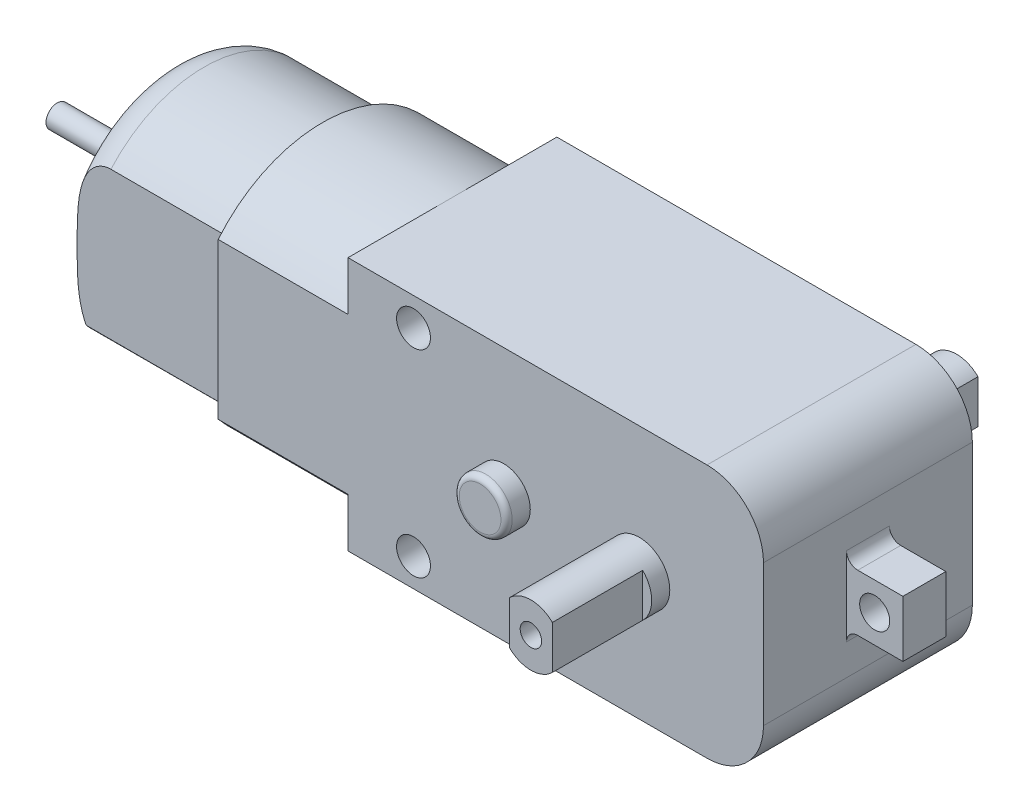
ISO-10303-21;
HEADER;
FILE_DESCRIPTION(('STEP AP214'),'2;1');
FILE_NAME('part.step','',(''),(''),'','','');
FILE_SCHEMA(('AUTOMOTIVE_DESIGN { 1 0 10303 214 1 1 1 1 }'));
ENDSEC;
DATA;
#1=APPLICATION_CONTEXT('core data for automotive mechanical design processes');
#2=APPLICATION_PROTOCOL_DEFINITION('international standard','automotive_design',2000,#1);
#3=PRODUCT_CONTEXT('',#1,'mechanical');
#4=PRODUCT('Part','Part','',(#3));
#5=PRODUCT_RELATED_PRODUCT_CATEGORY('part','',(#4));
#6=PRODUCT_DEFINITION_FORMATION('','',#4);
#7=PRODUCT_DEFINITION_CONTEXT('part definition',#1,'design');
#8=PRODUCT_DEFINITION('design','',#6,#7);
#9=PRODUCT_DEFINITION_SHAPE('','',#8);
#10=(LENGTH_UNIT() NAMED_UNIT(*) SI_UNIT(.MILLI.,.METRE.));
#11=(NAMED_UNIT(*) PLANE_ANGLE_UNIT() SI_UNIT($,.RADIAN.));
#12=(NAMED_UNIT(*) SI_UNIT($,.STERADIAN.) SOLID_ANGLE_UNIT());
#13=UNCERTAINTY_MEASURE_WITH_UNIT(LENGTH_MEASURE(1.E-05),#10,'distance_accuracy_value','');
#14=(GEOMETRIC_REPRESENTATION_CONTEXT(3) GLOBAL_UNCERTAINTY_ASSIGNED_CONTEXT((#13)) GLOBAL_UNIT_ASSIGNED_CONTEXT((#10,
#11,#12)) REPRESENTATION_CONTEXT('',''));
#15=CARTESIAN_POINT('',(0.,0.,0.));
#16=DIRECTION('',(0.,0.,1.));
#17=DIRECTION('',(1.,0.,0.));
#18=AXIS2_PLACEMENT_3D('',#15,#16,#17);
#19=CARTESIAN_POINT('',(25.8,0.,-18.85));
#20=DIRECTION('',(0.,0.,-1.));
#21=DIRECTION('',(1.,0.,0.));
#22=AXIS2_PLACEMENT_3D('',#19,#20,#21);
#23=PLANE('',#22);
#24=DIRECTION('',(0.,-1.,0.));
#25=VECTOR('',#24,1.);
#26=CARTESIAN_POINT('',(23.9,0.,-18.85));
#27=LINE('',#26,#25);
#28=CARTESIAN_POINT('',(23.9,1.91833260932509,-18.85));
#29=VERTEX_POINT('',#28);
#30=CARTESIAN_POINT('',(23.9,-1.91833260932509,-18.85));
#31=VERTEX_POINT('',#30);
#32=EDGE_CURVE('E239',#29,#31,#27,.T.);
#33=ORIENTED_EDGE('',*,*,#32,.F.);
#34=CARTESIAN_POINT('',(25.8,0.,-18.85));
#35=DIRECTION('',(0.,0.,1.));
#36=DIRECTION('',(1.,0.,0.));
#37=AXIS2_PLACEMENT_3D('',#34,#35,#36);
#38=CIRCLE('',#37,2.7);
#39=CARTESIAN_POINT('',(27.7,1.91833260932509,-18.85));
#40=VERTEX_POINT('',#39);
#41=EDGE_CURVE('E247',#40,#29,#38,.T.);
#42=ORIENTED_EDGE('',*,*,#41,.F.);
#43=DIRECTION('',(0.,1.,0.));
#44=VECTOR('',#43,1.);
#45=CARTESIAN_POINT('',(27.7,0.,-18.85));
#46=LINE('',#45,#44);
#47=CARTESIAN_POINT('',(27.7,-1.91833260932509,-18.85));
#48=VERTEX_POINT('',#47);
#49=EDGE_CURVE('E230',#48,#40,#46,.T.);
#50=ORIENTED_EDGE('',*,*,#49,.F.);
#51=EDGE_CURVE('E253',#31,#48,#38,.T.);
#52=ORIENTED_EDGE('',*,*,#51,.F.);
#53=EDGE_LOOP('',(#33,#42,#50,#52));
#54=FACE_BOUND('',#53,.T.);
#55=CARTESIAN_POINT('',(25.8,0.,-18.85));
#56=DIRECTION('',(0.,0.,1.));
#57=DIRECTION('',(1.,0.,0.));
#58=AXIS2_PLACEMENT_3D('',#55,#56,#57);
#59=CIRCLE('',#58,0.950000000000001);
#60=CARTESIAN_POINT('',(26.75,0.,-18.85));
#61=VERTEX_POINT('',#60);
#62=EDGE_CURVE('E480',#61,#61,#59,.T.);
#63=ORIENTED_EDGE('',*,*,#62,.T.);
#64=EDGE_LOOP('',(#63));
#65=FACE_BOUND('',#64,.T.);
#66=ADVANCED_FACE('F37',(#54,#65),#23,.T.);
#67=CARTESIAN_POINT('',(25.8,0.,18.85));
#68=DIRECTION('',(0.,0.,-1.));
#69=DIRECTION('',(-1.,0.,0.));
#70=AXIS2_PLACEMENT_3D('',#67,#68,#69);
#71=CYLINDRICAL_SURFACE('',#70,2.7);
#72=CARTESIAN_POINT('',(25.8,0.,9.25));
#73=DIRECTION('',(0.,0.,1.));
#74=DIRECTION('',(1.,0.,0.));
#75=AXIS2_PLACEMENT_3D('',#72,#73,#74);
#76=CIRCLE('',#75,2.7);
#77=CARTESIAN_POINT('',(28.5,0.,9.25));
#78=VERTEX_POINT('',#77);
#79=EDGE_CURVE('E288',#78,#78,#76,.T.);
#80=ORIENTED_EDGE('',*,*,#79,.T.);
#81=EDGE_LOOP('',(#80));
#82=FACE_BOUND('',#81,.T.);
#83=DIRECTION('',(0.,0.,-1.));
#84=VECTOR('',#83,1.);
#85=CARTESIAN_POINT('',(23.9,1.91833260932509,18.85));
#86=LINE('',#85,#84);
#87=CARTESIAN_POINT('',(23.9,1.91833260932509,18.85));
#88=VERTEX_POINT('',#87);
#89=CARTESIAN_POINT('',(23.9,1.91833260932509,10.85));
#90=VERTEX_POINT('',#89);
#91=EDGE_CURVE('E286',#88,#90,#86,.T.);
#92=ORIENTED_EDGE('',*,*,#91,.F.);
#93=CARTESIAN_POINT('',(25.8,0.,18.85));
#94=DIRECTION('',(0.,0.,1.));
#95=DIRECTION('',(1.,0.,0.));
#96=AXIS2_PLACEMENT_3D('',#93,#94,#95);
#97=CIRCLE('',#96,2.7);
#98=CARTESIAN_POINT('',(27.7,1.91833260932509,18.85));
#99=VERTEX_POINT('',#98);
#100=EDGE_CURVE('E289',#99,#88,#97,.T.);
#101=ORIENTED_EDGE('',*,*,#100,.F.);
#102=DIRECTION('',(0.,0.,-1.));
#103=VECTOR('',#102,1.);
#104=CARTESIAN_POINT('',(27.7,1.91833260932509,18.85));
#105=LINE('',#104,#103);
#106=CARTESIAN_POINT('',(27.7,1.91833260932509,10.85));
#107=VERTEX_POINT('',#106);
#108=EDGE_CURVE('E280',#107,#99,#105,.F.);
#109=ORIENTED_EDGE('',*,*,#108,.F.);
#110=CARTESIAN_POINT('',(25.8,0.,10.85));
#111=DIRECTION('',(0.,0.,1.));
#112=DIRECTION('',(1.,0.,0.));
#113=AXIS2_PLACEMENT_3D('',#110,#111,#112);
#114=CIRCLE('',#113,2.7);
#115=CARTESIAN_POINT('',(27.7,-1.91833260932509,10.85));
#116=VERTEX_POINT('',#115);
#117=EDGE_CURVE('E457',#116,#107,#114,.T.);
#118=ORIENTED_EDGE('',*,*,#117,.F.);
#119=DIRECTION('',(0.,0.,-1.));
#120=VECTOR('',#119,1.);
#121=CARTESIAN_POINT('',(27.7,-1.91833260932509,18.85));
#122=LINE('',#121,#120);
#123=CARTESIAN_POINT('',(27.7,-1.91833260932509,18.85));
#124=VERTEX_POINT('',#123);
#125=EDGE_CURVE('E282',#124,#116,#122,.T.);
#126=ORIENTED_EDGE('',*,*,#125,.F.);
#127=CARTESIAN_POINT('',(23.9,-1.91833260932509,18.85));
#128=VERTEX_POINT('',#127);
#129=EDGE_CURVE('E293',#128,#124,#97,.T.);
#130=ORIENTED_EDGE('',*,*,#129,.F.);
#131=DIRECTION('',(0.,0.,-1.));
#132=VECTOR('',#131,1.);
#133=CARTESIAN_POINT('',(23.9,-1.91833260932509,18.85));
#134=LINE('',#133,#132);
#135=CARTESIAN_POINT('',(23.9,-1.91833260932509,10.85));
#136=VERTEX_POINT('',#135);
#137=EDGE_CURVE('E284',#136,#128,#134,.F.);
#138=ORIENTED_EDGE('',*,*,#137,.F.);
#139=EDGE_CURVE('E240',#90,#136,#114,.T.);
#140=ORIENTED_EDGE('',*,*,#139,.F.);
#141=EDGE_LOOP('',(#92,#101,#109,#118,#126,#130,#138,#140));
#142=FACE_BOUND('',#141,.T.);
#143=ADVANCED_FACE('F508',(#82,#142),#71,.T.);
#144=CARTESIAN_POINT('',(25.8,0.,18.85));
#145=DIRECTION('',(0.,0.,1.));
#146=DIRECTION('',(1.,0.,0.));
#147=AXIS2_PLACEMENT_3D('',#144,#145,#146);
#148=PLANE('',#147);
#149=CARTESIAN_POINT('',(25.8,0.,18.85));
#150=DIRECTION('',(0.,0.,1.));
#151=DIRECTION('',(1.,0.,0.));
#152=AXIS2_PLACEMENT_3D('',#149,#150,#151);
#153=CIRCLE('',#152,0.950000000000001);
#154=CARTESIAN_POINT('',(26.75,0.,18.85));
#155=VERTEX_POINT('',#154);
#156=EDGE_CURVE('E272',#155,#155,#153,.T.);
#157=ORIENTED_EDGE('',*,*,#156,.F.);
#158=EDGE_LOOP('',(#157));
#159=FACE_BOUND('',#158,.T.);
#160=ORIENTED_EDGE('',*,*,#100,.T.);
#161=DIRECTION('',(0.,-1.,0.));
#162=VECTOR('',#161,1.);
#163=CARTESIAN_POINT('',(23.9,0.,18.85));
#164=LINE('',#163,#162);
#165=EDGE_CURVE('E454',#88,#128,#164,.T.);
#166=ORIENTED_EDGE('',*,*,#165,.T.);
#167=ORIENTED_EDGE('',*,*,#129,.T.);
#168=DIRECTION('',(0.,1.,0.));
#169=VECTOR('',#168,1.);
#170=CARTESIAN_POINT('',(27.7,0.,18.85));
#171=LINE('',#170,#169);
#172=EDGE_CURVE('E449',#124,#99,#171,.T.);
#173=ORIENTED_EDGE('',*,*,#172,.T.);
#174=EDGE_LOOP('',(#160,#166,#167,#173));
#175=FACE_BOUND('',#174,.T.);
#176=ADVANCED_FACE('F495',(#159,#175),#148,.T.);
#177=CARTESIAN_POINT('',(0.,0.,9.25));
#178=DIRECTION('',(0.,0.,1.));
#179=DIRECTION('',(1.,0.,0.));
#180=AXIS2_PLACEMENT_3D('',#177,#178,#179);
#181=PLANE('',#180);
#182=CARTESIAN_POINT('',(13.8,0.,9.25));
#183=DIRECTION('',(0.,0.,1.));
#184=DIRECTION('',(1.,0.,0.));
#185=AXIS2_PLACEMENT_3D('',#182,#183,#184);
#186=CIRCLE('',#185,2.34492403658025);
#187=CARTESIAN_POINT('',(16.1449240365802,0.,9.25));
#188=VERTEX_POINT('',#187);
#189=EDGE_CURVE('E485',#188,#188,#186,.T.);
#190=ORIENTED_EDGE('',*,*,#189,.F.);
#191=EDGE_LOOP('',(#190));
#192=FACE_BOUND('',#191,.T.);
#193=CARTESIAN_POINT('',(5.8,-8.75,9.25));
#194=DIRECTION('',(0.,0.,1.));
#195=DIRECTION('',(-1.,0.,0.));
#196=AXIS2_PLACEMENT_3D('',#193,#194,#195);
#197=CIRCLE('',#196,1.5);
#198=CARTESIAN_POINT('',(7.3,-8.75,9.25));
#199=VERTEX_POINT('',#198);
#200=EDGE_CURVE('E252',#199,#199,#197,.T.);
#201=ORIENTED_EDGE('',*,*,#200,.F.);
#202=EDGE_LOOP('',(#201));
#203=FACE_BOUND('',#202,.T.);
#204=CARTESIAN_POINT('',(5.8,8.75,9.25));
#205=DIRECTION('',(0.,0.,1.));
#206=DIRECTION('',(1.,0.,0.));
#207=AXIS2_PLACEMENT_3D('',#204,#205,#206);
#208=CIRCLE('',#207,1.5);
#209=CARTESIAN_POINT('',(7.3,8.75,9.25));
#210=VERTEX_POINT('',#209);
#211=EDGE_CURVE('E264',#210,#210,#208,.T.);
#212=ORIENTED_EDGE('',*,*,#211,.F.);
#213=EDGE_LOOP('',(#212));
#214=FACE_BOUND('',#213,.T.);
#215=DIRECTION('',(1.,0.,0.));
#216=VECTOR('',#215,1.);
#217=CARTESIAN_POINT('',(0.,-11.25,9.25));
#218=LINE('',#217,#216);
#219=CARTESIAN_POINT('',(0.,-11.25,9.25));
#220=VERTEX_POINT('',#219);
#221=CARTESIAN_POINT('',(31.8,-11.25,9.25));
#222=VERTEX_POINT('',#221);
#223=EDGE_CURVE('E504',#220,#222,#218,.T.);
#224=ORIENTED_EDGE('',*,*,#223,.T.);
#225=CARTESIAN_POINT('',(31.8,-6.25,9.25));
#226=DIRECTION('',(0.,0.,1.));
#227=DIRECTION('',(1.,0.,0.));
#228=AXIS2_PLACEMENT_3D('',#225,#226,#227);
#229=CIRCLE('',#228,5.);
#230=CARTESIAN_POINT('',(36.8,-6.24999999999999,9.25));
#231=VERTEX_POINT('',#230);
#232=EDGE_CURVE('E1027',#222,#231,#229,.T.);
#233=ORIENTED_EDGE('',*,*,#232,.T.);
#234=DIRECTION('',(0.,1.,0.));
#235=VECTOR('',#234,1.);
#236=CARTESIAN_POINT('',(36.8,11.25,9.25));
#237=LINE('',#236,#235);
#238=CARTESIAN_POINT('',(36.8,6.25,9.25));
#239=VERTEX_POINT('',#238);
#240=EDGE_CURVE('E1016',#231,#239,#237,.T.);
#241=ORIENTED_EDGE('',*,*,#240,.T.);
#242=CARTESIAN_POINT('',(31.8,6.25,9.25));
#243=DIRECTION('',(0.,0.,1.));
#244=DIRECTION('',(1.,0.,0.));
#245=AXIS2_PLACEMENT_3D('',#242,#243,#244);
#246=CIRCLE('',#245,5.);
#247=CARTESIAN_POINT('',(31.8,11.25,9.25));
#248=VERTEX_POINT('',#247);
#249=EDGE_CURVE('E1039',#239,#248,#246,.T.);
#250=ORIENTED_EDGE('',*,*,#249,.T.);
#251=DIRECTION('',(-1.,0.,0.));
#252=VECTOR('',#251,1.);
#253=CARTESIAN_POINT('',(0.,11.25,9.25));
#254=LINE('',#253,#252);
#255=CARTESIAN_POINT('',(0.,11.25,9.25));
#256=VERTEX_POINT('',#255);
#257=EDGE_CURVE('E1024',#248,#256,#254,.T.);
#258=ORIENTED_EDGE('',*,*,#257,.T.);
#259=DIRECTION('',(0.,-1.,0.));
#260=VECTOR('',#259,1.);
#261=CARTESIAN_POINT('',(0.,11.25,9.25));
#262=LINE('',#261,#260);
#263=CARTESIAN_POINT('',(0.,6.9,9.25));
#264=VERTEX_POINT('',#263);
#265=EDGE_CURVE('E1105',#256,#264,#262,.T.);
#266=ORIENTED_EDGE('',*,*,#265,.T.);
#267=DIRECTION('',(1.,0.,0.));
#268=VECTOR('',#267,1.);
#269=CARTESIAN_POINT('',(-11.5,6.9,9.25));
#270=LINE('',#269,#268);
#271=CARTESIAN_POINT('',(-11.5,6.9,9.25));
#272=VERTEX_POINT('',#271);
#273=EDGE_CURVE('E360',#272,#264,#270,.T.);
#274=ORIENTED_EDGE('',*,*,#273,.F.);
#275=DIRECTION('',(0.,1.,0.));
#276=VECTOR('',#275,1.);
#277=CARTESIAN_POINT('',(-11.5,-6.9,9.25));
#278=LINE('',#277,#276);
#279=CARTESIAN_POINT('',(-11.5,-6.9,9.25));
#280=VERTEX_POINT('',#279);
#281=EDGE_CURVE('E358',#280,#272,#278,.T.);
#282=ORIENTED_EDGE('',*,*,#281,.F.);
#283=DIRECTION('',(1.,0.,0.));
#284=VECTOR('',#283,1.);
#285=CARTESIAN_POINT('',(-11.5,-6.9,9.25));
#286=LINE('',#285,#284);
#287=CARTESIAN_POINT('',(0.,-6.9,9.25));
#288=VERTEX_POINT('',#287);
#289=EDGE_CURVE('E378',#280,#288,#286,.T.);
#290=ORIENTED_EDGE('',*,*,#289,.T.);
#291=EDGE_CURVE('E1063',#288,#220,#262,.T.);
#292=ORIENTED_EDGE('',*,*,#291,.T.);
#293=EDGE_LOOP('',(#224,#233,#241,#250,#258,#266,#274,#282,#290,#292));
#294=FACE_BOUND('',#293,.T.);
#295=ORIENTED_EDGE('',*,*,#79,.F.);
#296=EDGE_LOOP('',(#295));
#297=FACE_BOUND('',#296,.T.);
#298=ADVANCED_FACE('F492',(#192,#203,#214,#294,#297),#181,.T.);
#299=CARTESIAN_POINT('',(-25.,-0.759770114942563,0.));
#300=DIRECTION('',(-1.,0.,0.));
#301=DIRECTION('',(0.,-1.,0.));
#302=AXIS2_PLACEMENT_3D('',#299,#300,#301);
#303=PLANE('',#302);
#304=CARTESIAN_POINT('',(-25.,-0.759770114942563,0.));
#305=DIRECTION('',(-1.,0.,0.));
#306=DIRECTION('',(0.,-1.,0.));
#307=AXIS2_PLACEMENT_3D('',#304,#305,#306);
#308=CIRCLE('',#307,8.00977011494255);
#309=CARTESIAN_POINT('',(-25.,4.54423341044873,6.00199665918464));
#310=VERTEX_POINT('',#309);
#311=EDGE_CURVE('E381',#310,#310,#308,.T.);
#312=ORIENTED_EDGE('',*,*,#311,.T.);
#313=EDGE_LOOP('',(#312));
#314=FACE_BOUND('',#313,.T.);
#315=CARTESIAN_POINT('',(-25.,0.,0.));
#316=DIRECTION('',(-1.,0.,0.));
#317=DIRECTION('',(0.,-1.,0.));
#318=AXIS2_PLACEMENT_3D('',#315,#316,#317);
#319=CIRCLE('',#318,1.);
#320=CARTESIAN_POINT('',(-25.,-1.,0.));
#321=VERTEX_POINT('',#320);
#322=EDGE_CURVE('E323',#321,#321,#319,.T.);
#323=ORIENTED_EDGE('',*,*,#322,.F.);
#324=EDGE_LOOP('',(#323));
#325=FACE_BOUND('',#324,.T.);
#326=ADVANCED_FACE('F410',(#314,#325),#303,.T.);
#327=CARTESIAN_POINT('',(-11.5,-0.759770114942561,0.));
#328=DIRECTION('',(1.,0.,0.));
#329=DIRECTION('',(0.,1.,0.));
#330=AXIS2_PLACEMENT_3D('',#327,#328,#329);
#331=PLANE('',#330);
#332=CARTESIAN_POINT('',(-11.5,-0.759770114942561,0.));
#333=DIRECTION('',(-1.,0.,0.));
#334=DIRECTION('',(0.,1.,0.));
#335=AXIS2_PLACEMENT_3D('',#332,#333,#334);
#336=CIRCLE('',#335,12.0097701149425);
#337=CARTESIAN_POINT('',(-11.5,6.9,-9.25));
#338=VERTEX_POINT('',#337);
#339=EDGE_CURVE('E350',#272,#338,#336,.T.);
#340=ORIENTED_EDGE('',*,*,#339,.T.);
#341=DIRECTION('',(0.,-1.,0.));
#342=VECTOR('',#341,1.);
#343=CARTESIAN_POINT('',(-11.5,-6.9,-9.25));
#344=LINE('',#343,#342);
#345=CARTESIAN_POINT('',(-11.5,-6.9,-9.25));
#346=VERTEX_POINT('',#345);
#347=EDGE_CURVE('E353',#338,#346,#344,.T.);
#348=ORIENTED_EDGE('',*,*,#347,.T.);
#349=CARTESIAN_POINT('',(-11.5,0.759770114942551,0.));
#350=DIRECTION('',(-1.,0.,0.));
#351=DIRECTION('',(0.,-1.,0.));
#352=AXIS2_PLACEMENT_3D('',#349,#350,#351);
#353=CIRCLE('',#352,12.0097701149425);
#354=EDGE_CURVE('E356',#346,#280,#353,.T.);
#355=ORIENTED_EDGE('',*,*,#354,.T.);
#356=ORIENTED_EDGE('',*,*,#281,.T.);
#357=EDGE_LOOP('',(#340,#348,#355,#356));
#358=FACE_BOUND('',#357,.T.);
#359=CARTESIAN_POINT('',(-11.5,-0.759770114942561,0.));
#360=DIRECTION('',(-1.,0.,0.));
#361=DIRECTION('',(0.,-1.,0.));
#362=AXIS2_PLACEMENT_3D('',#359,#360,#361);
#363=CIRCLE('',#362,11.0097701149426);
#364=CARTESIAN_POINT('',(-11.5,6.53080859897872,8.25));
#365=VERTEX_POINT('',#364);
#366=CARTESIAN_POINT('',(-11.5,6.53080859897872,-8.25));
#367=VERTEX_POINT('',#366);
#368=EDGE_CURVE('E327',#365,#367,#363,.T.);
#369=ORIENTED_EDGE('',*,*,#368,.F.);
#370=DIRECTION('',(0.,1.,0.));
#371=VECTOR('',#370,1.);
#372=CARTESIAN_POINT('',(-11.5,-6.53080859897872,8.25));
#373=LINE('',#372,#371);
#374=CARTESIAN_POINT('',(-11.5,-6.53080859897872,8.25));
#375=VERTEX_POINT('',#374);
#376=EDGE_CURVE('E338',#375,#365,#373,.T.);
#377=ORIENTED_EDGE('',*,*,#376,.F.);
#378=CARTESIAN_POINT('',(-11.5,0.759770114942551,0.));
#379=DIRECTION('',(-1.,0.,0.));
#380=DIRECTION('',(0.,-1.,0.));
#381=AXIS2_PLACEMENT_3D('',#378,#379,#380);
#382=CIRCLE('',#381,11.0097701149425);
#383=CARTESIAN_POINT('',(-11.5,-6.53080859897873,-8.25));
#384=VERTEX_POINT('',#383);
#385=EDGE_CURVE('E335',#384,#375,#382,.T.);
#386=ORIENTED_EDGE('',*,*,#385,.F.);
#387=DIRECTION('',(0.,-1.,0.));
#388=VECTOR('',#387,1.);
#389=CARTESIAN_POINT('',(-11.5,6.53080859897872,-8.25));
#390=LINE('',#389,#388);
#391=EDGE_CURVE('E332',#367,#384,#390,.T.);
#392=ORIENTED_EDGE('',*,*,#391,.F.);
#393=EDGE_LOOP('',(#369,#377,#386,#392));
#394=FACE_BOUND('',#393,.T.);
#395=ADVANCED_FACE('F728',(#358,#394),#331,.F.);
#396=CARTESIAN_POINT('',(0.,11.25,9.25));
#397=DIRECTION('',(1.,0.,0.));
#398=DIRECTION('',(0.,1.,0.));
#399=AXIS2_PLACEMENT_3D('',#396,#397,#398);
#400=PLANE('',#399);
#401=CARTESIAN_POINT('',(0.,-0.759770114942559,0.));
#402=DIRECTION('',(-1.,0.,0.));
#403=DIRECTION('',(0.,1.,0.));
#404=AXIS2_PLACEMENT_3D('',#401,#402,#403);
#405=CIRCLE('',#404,12.0097701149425);
#406=CARTESIAN_POINT('',(0.,11.25,0.));
#407=VERTEX_POINT('',#406);
#408=EDGE_CURVE('E349',#264,#407,#405,.T.);
#409=ORIENTED_EDGE('',*,*,#408,.F.);
#410=ORIENTED_EDGE('',*,*,#265,.F.);
#411=DIRECTION('',(0.,0.,-1.));
#412=VECTOR('',#411,1.);
#413=CARTESIAN_POINT('',(0.,11.25,9.25));
#414=LINE('',#413,#412);
#415=EDGE_CURVE('E1064',#256,#407,#414,.T.);
#416=ORIENTED_EDGE('',*,*,#415,.T.);
#417=EDGE_LOOP('',(#409,#410,#416));
#418=FACE_BOUND('',#417,.T.);
#419=ADVANCED_FACE('F737',(#418),#400,.F.);
#420=CARTESIAN_POINT('',(0.,6.9,-9.25));
#421=VERTEX_POINT('',#420);
#422=EDGE_CURVE('E367',#407,#421,#405,.T.);
#423=ORIENTED_EDGE('',*,*,#422,.F.);
#424=CARTESIAN_POINT('',(0.,11.25,-9.25));
#425=VERTEX_POINT('',#424);
#426=EDGE_CURVE('E1067',#407,#425,#414,.T.);
#427=ORIENTED_EDGE('',*,*,#426,.T.);
#428=DIRECTION('',(0.,-1.,0.));
#429=VECTOR('',#428,1.);
#430=CARTESIAN_POINT('',(0.,11.25,-9.25));
#431=LINE('',#430,#429);
#432=EDGE_CURVE('E1046',#425,#421,#431,.T.);
#433=ORIENTED_EDGE('',*,*,#432,.T.);
#434=EDGE_LOOP('',(#423,#427,#433));
#435=FACE_BOUND('',#434,.T.);
#436=ADVANCED_FACE('F746',(#435),#400,.F.);
#437=CARTESIAN_POINT('',(0.,0.759770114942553,0.));
#438=DIRECTION('',(-1.,0.,0.));
#439=DIRECTION('',(0.,-1.,0.));
#440=AXIS2_PLACEMENT_3D('',#437,#438,#439);
#441=CIRCLE('',#440,12.0097701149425);
#442=CARTESIAN_POINT('',(0.,-6.9,-9.25));
#443=VERTEX_POINT('',#442);
#444=CARTESIAN_POINT('',(0.,-11.25,0.));
#445=VERTEX_POINT('',#444);
#446=EDGE_CURVE('E354',#443,#445,#441,.T.);
#447=ORIENTED_EDGE('',*,*,#446,.F.);
#448=CARTESIAN_POINT('',(0.,-11.25,-9.25));
#449=VERTEX_POINT('',#448);
#450=EDGE_CURVE('E1050',#443,#449,#431,.T.);
#451=ORIENTED_EDGE('',*,*,#450,.T.);
#452=DIRECTION('',(0.,0.,-1.));
#453=VECTOR('',#452,1.);
#454=CARTESIAN_POINT('',(0.,-11.25,9.25));
#455=LINE('',#454,#453);
#456=EDGE_CURVE('E1066',#445,#449,#455,.T.);
#457=ORIENTED_EDGE('',*,*,#456,.F.);
#458=EDGE_LOOP('',(#447,#451,#457));
#459=FACE_BOUND('',#458,.T.);
#460=ADVANCED_FACE('F756',(#459),#400,.F.);
#461=EDGE_CURVE('E1045',#445,#288,#441,.T.);
#462=ORIENTED_EDGE('',*,*,#461,.F.);
#463=EDGE_CURVE('E1032',#220,#445,#455,.T.);
#464=ORIENTED_EDGE('',*,*,#463,.F.);
#465=ORIENTED_EDGE('',*,*,#291,.F.);
#466=EDGE_LOOP('',(#462,#464,#465));
#467=FACE_BOUND('',#466,.T.);
#468=ADVANCED_FACE('F749',(#467),#400,.F.);
#469=CARTESIAN_POINT('',(0.,-11.25,9.25));
#470=DIRECTION('',(0.,1.,0.));
#471=DIRECTION('',(-1.,0.,0.));
#472=AXIS2_PLACEMENT_3D('',#469,#470,#471);
#473=PLANE('',#472);
#474=DIRECTION('',(1.,0.,0.));
#475=VECTOR('',#474,1.);
#476=CARTESIAN_POINT('',(0.,-11.25,-9.25));
#477=LINE('',#476,#475);
#478=CARTESIAN_POINT('',(31.8,-11.25,-9.25));
#479=VERTEX_POINT('',#478);
#480=EDGE_CURVE('E1049',#449,#479,#477,.T.);
#481=ORIENTED_EDGE('',*,*,#480,.T.);
#482=DIRECTION('',(0.,0.,-1.));
#483=VECTOR('',#482,1.);
#484=CARTESIAN_POINT('',(31.8,-11.25,9.25));
#485=LINE('',#484,#483);
#486=EDGE_CURVE('E1037',#479,#222,#485,.F.);
#487=ORIENTED_EDGE('',*,*,#486,.T.);
#488=ORIENTED_EDGE('',*,*,#223,.F.);
#489=ORIENTED_EDGE('',*,*,#463,.T.);
#490=ORIENTED_EDGE('',*,*,#456,.T.);
#491=EDGE_LOOP('',(#481,#487,#488,#489,#490));
#492=FACE_BOUND('',#491,.T.);
#493=ADVANCED_FACE('F769',(#492),#473,.F.);
#494=CARTESIAN_POINT('',(36.8,11.25,9.25));
#495=DIRECTION('',(-1.,0.,0.));
#496=DIRECTION('',(0.,0.,1.));
#497=AXIS2_PLACEMENT_3D('',#494,#495,#496);
#498=PLANE('',#497);
#499=DIRECTION('',(0.,-1.,0.));
#500=VECTOR('',#499,1.);
#501=CARTESIAN_POINT('',(36.8,2.5,-1.9));
#502=LINE('',#501,#500);
#503=CARTESIAN_POINT('',(36.8,3.5,-1.9));
#504=VERTEX_POINT('',#503);
#505=CARTESIAN_POINT('',(36.8,-3.5,-1.9));
#506=VERTEX_POINT('',#505);
#507=EDGE_CURVE('E310',#504,#506,#502,.T.);
#508=ORIENTED_EDGE('',*,*,#507,.T.);
#509=DIRECTION('',(0.,0.,-1.));
#510=VECTOR('',#509,1.);
#511=CARTESIAN_POINT('',(36.8,-3.5,1.9));
#512=LINE('',#511,#510);
#513=CARTESIAN_POINT('',(36.8,-3.5,1.9));
#514=VERTEX_POINT('',#513);
#515=EDGE_CURVE('E434',#506,#514,#512,.F.);
#516=ORIENTED_EDGE('',*,*,#515,.T.);
#517=DIRECTION('',(0.,-1.,0.));
#518=VECTOR('',#517,1.);
#519=CARTESIAN_POINT('',(36.8,2.5,1.9));
#520=LINE('',#519,#518);
#521=CARTESIAN_POINT('',(36.8,3.5,1.9));
#522=VERTEX_POINT('',#521);
#523=EDGE_CURVE('E299',#522,#514,#520,.T.);
#524=ORIENTED_EDGE('',*,*,#523,.F.);
#525=DIRECTION('',(0.,0.,-1.));
#526=VECTOR('',#525,1.);
#527=CARTESIAN_POINT('',(36.8,3.5,-1.9));
#528=LINE('',#527,#526);
#529=EDGE_CURVE('E431',#522,#504,#528,.T.);
#530=ORIENTED_EDGE('',*,*,#529,.T.);
#531=EDGE_LOOP('',(#508,#516,#524,#530));
#532=FACE_BOUND('',#531,.T.);
#533=ORIENTED_EDGE('',*,*,#240,.F.);
#534=DIRECTION('',(0.,0.,-1.));
#535=VECTOR('',#534,1.);
#536=CARTESIAN_POINT('',(36.8,-6.25,9.25));
#537=LINE('',#536,#535);
#538=CARTESIAN_POINT('',(36.8,-6.24999999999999,-9.25));
#539=VERTEX_POINT('',#538);
#540=EDGE_CURVE('E1019',#231,#539,#537,.T.);
#541=ORIENTED_EDGE('',*,*,#540,.T.);
#542=DIRECTION('',(0.,1.,0.));
#543=VECTOR('',#542,1.);
#544=CARTESIAN_POINT('',(36.8,11.25,-9.25));
#545=LINE('',#544,#543);
#546=CARTESIAN_POINT('',(36.8,6.25,-9.25));
#547=VERTEX_POINT('',#546);
#548=EDGE_CURVE('E1058',#539,#547,#545,.T.);
#549=ORIENTED_EDGE('',*,*,#548,.T.);
#550=DIRECTION('',(0.,0.,-1.));
#551=VECTOR('',#550,1.);
#552=CARTESIAN_POINT('',(36.8,6.25,9.25));
#553=LINE('',#552,#551);
#554=EDGE_CURVE('E1022',#547,#239,#553,.F.);
#555=ORIENTED_EDGE('',*,*,#554,.T.);
#556=EDGE_LOOP('',(#533,#541,#549,#555));
#557=FACE_BOUND('',#556,.T.);
#558=ADVANCED_FACE('F776',(#532,#557),#498,.F.);
#559=CARTESIAN_POINT('',(0.,11.25,9.25));
#560=DIRECTION('',(0.,-1.,0.));
#561=DIRECTION('',(1.,0.,0.));
#562=AXIS2_PLACEMENT_3D('',#559,#560,#561);
#563=PLANE('',#562);
#564=ORIENTED_EDGE('',*,*,#257,.F.);
#565=DIRECTION('',(0.,0.,-1.));
#566=VECTOR('',#565,1.);
#567=CARTESIAN_POINT('',(31.8,11.25,9.25));
#568=LINE('',#567,#566);
#569=CARTESIAN_POINT('',(31.8,11.25,-9.25));
#570=VERTEX_POINT('',#569);
#571=EDGE_CURVE('E1042',#248,#570,#568,.T.);
#572=ORIENTED_EDGE('',*,*,#571,.T.);
#573=DIRECTION('',(-1.,0.,0.));
#574=VECTOR('',#573,1.);
#575=CARTESIAN_POINT('',(0.,11.25,-9.25));
#576=LINE('',#575,#574);
#577=EDGE_CURVE('E1060',#570,#425,#576,.T.);
#578=ORIENTED_EDGE('',*,*,#577,.T.);
#579=ORIENTED_EDGE('',*,*,#426,.F.);
#580=ORIENTED_EDGE('',*,*,#415,.F.);
#581=EDGE_LOOP('',(#564,#572,#578,#579,#580));
#582=FACE_BOUND('',#581,.T.);
#583=ADVANCED_FACE('F785',(#582),#563,.F.);
#584=CARTESIAN_POINT('',(0.,0.,-9.25));
#585=DIRECTION('',(0.,0.,1.));
#586=DIRECTION('',(1.,0.,0.));
#587=AXIS2_PLACEMENT_3D('',#584,#585,#586);
#588=PLANE('',#587);
#589=CARTESIAN_POINT('',(25.8,0.,-9.25));
#590=DIRECTION('',(0.,0.,1.));
#591=DIRECTION('',(1.,0.,0.));
#592=AXIS2_PLACEMENT_3D('',#589,#590,#591);
#593=CIRCLE('',#592,2.7);
#594=CARTESIAN_POINT('',(28.5,0.,-9.25));
#595=VERTEX_POINT('',#594);
#596=EDGE_CURVE('E258',#595,#595,#593,.T.);
#597=ORIENTED_EDGE('',*,*,#596,.T.);
#598=EDGE_LOOP('',(#597));
#599=FACE_BOUND('',#598,.T.);
#600=CARTESIAN_POINT('',(5.8,-8.75,-9.25));
#601=DIRECTION('',(0.,0.,1.));
#602=DIRECTION('',(1.,0.,0.));
#603=AXIS2_PLACEMENT_3D('',#600,#601,#602);
#604=CIRCLE('',#603,1.5);
#605=CARTESIAN_POINT('',(7.3,-8.75,-9.25));
#606=VERTEX_POINT('',#605);
#607=EDGE_CURVE('E256',#606,#606,#604,.T.);
#608=ORIENTED_EDGE('',*,*,#607,.T.);
#609=EDGE_LOOP('',(#608));
#610=FACE_BOUND('',#609,.T.);
#611=CARTESIAN_POINT('',(5.8,8.75,-9.25));
#612=DIRECTION('',(0.,0.,1.));
#613=DIRECTION('',(1.,0.,0.));
#614=AXIS2_PLACEMENT_3D('',#611,#612,#613);
#615=CIRCLE('',#614,1.5);
#616=CARTESIAN_POINT('',(7.3,8.75,-9.25));
#617=VERTEX_POINT('',#616);
#618=EDGE_CURVE('E267',#617,#617,#615,.T.);
#619=ORIENTED_EDGE('',*,*,#618,.T.);
#620=EDGE_LOOP('',(#619));
#621=FACE_BOUND('',#620,.T.);
#622=ORIENTED_EDGE('',*,*,#548,.F.);
#623=CARTESIAN_POINT('',(31.8,-6.25,-9.25));
#624=DIRECTION('',(0.,0.,1.));
#625=DIRECTION('',(1.,0.,0.));
#626=AXIS2_PLACEMENT_3D('',#623,#624,#625);
#627=CIRCLE('',#626,5.);
#628=EDGE_CURVE('E1028',#539,#479,#627,.F.);
#629=ORIENTED_EDGE('',*,*,#628,.T.);
#630=ORIENTED_EDGE('',*,*,#480,.F.);
#631=ORIENTED_EDGE('',*,*,#450,.F.);
#632=DIRECTION('',(1.,0.,0.));
#633=VECTOR('',#632,1.);
#634=CARTESIAN_POINT('',(-11.5,-6.9,-9.25));
#635=LINE('',#634,#633);
#636=EDGE_CURVE('E1091',#346,#443,#635,.T.);
#637=ORIENTED_EDGE('',*,*,#636,.F.);
#638=ORIENTED_EDGE('',*,*,#347,.F.);
#639=DIRECTION('',(1.,0.,0.));
#640=VECTOR('',#639,1.);
#641=CARTESIAN_POINT('',(-11.5,6.9,-9.25));
#642=LINE('',#641,#640);
#643=EDGE_CURVE('E1078',#338,#421,#642,.T.);
#644=ORIENTED_EDGE('',*,*,#643,.T.);
#645=ORIENTED_EDGE('',*,*,#432,.F.);
#646=ORIENTED_EDGE('',*,*,#577,.F.);
#647=CARTESIAN_POINT('',(31.8,6.25,-9.25));
#648=DIRECTION('',(0.,0.,1.));
#649=DIRECTION('',(1.,0.,0.));
#650=AXIS2_PLACEMENT_3D('',#647,#648,#649);
#651=CIRCLE('',#650,5.);
#652=EDGE_CURVE('E1029',#570,#547,#651,.F.);
#653=ORIENTED_EDGE('',*,*,#652,.T.);
#654=EDGE_LOOP('',(#622,#629,#630,#631,#637,#638,#644,#645,#646,#653));
#655=FACE_BOUND('',#654,.T.);
#656=ADVANCED_FACE('F794',(#599,#610,#621,#655),#588,.F.);
#657=CARTESIAN_POINT('',(31.8,-6.25,9.25));
#658=DIRECTION('',(0.,0.,-1.));
#659=DIRECTION('',(-1.,0.,0.));
#660=AXIS2_PLACEMENT_3D('',#657,#658,#659);
#661=CYLINDRICAL_SURFACE('',#660,5.);
#662=ORIENTED_EDGE('',*,*,#232,.F.);
#663=ORIENTED_EDGE('',*,*,#486,.F.);
#664=ORIENTED_EDGE('',*,*,#628,.F.);
#665=ORIENTED_EDGE('',*,*,#540,.F.);
#666=EDGE_LOOP('',(#662,#663,#664,#665));
#667=FACE_BOUND('',#666,.T.);
#668=ADVANCED_FACE('F802',(#667),#661,.T.);
#669=CARTESIAN_POINT('',(31.8,6.25,9.25));
#670=DIRECTION('',(0.,0.,-1.));
#671=DIRECTION('',(-1.,0.,0.));
#672=AXIS2_PLACEMENT_3D('',#669,#670,#671);
#673=CYLINDRICAL_SURFACE('',#672,5.);
#674=ORIENTED_EDGE('',*,*,#249,.F.);
#675=ORIENTED_EDGE('',*,*,#554,.F.);
#676=ORIENTED_EDGE('',*,*,#652,.F.);
#677=ORIENTED_EDGE('',*,*,#571,.F.);
#678=EDGE_LOOP('',(#674,#675,#676,#677));
#679=FACE_BOUND('',#678,.T.);
#680=ADVANCED_FACE('F810',(#679),#673,.T.);
#681=CARTESIAN_POINT('',(-11.5,-0.759770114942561,0.));
#682=DIRECTION('',(1.,0.,0.));
#683=DIRECTION('',(0.,1.,0.));
#684=AXIS2_PLACEMENT_3D('',#681,#682,#683);
#685=CYLINDRICAL_SURFACE('',#684,12.0097701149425);
#686=ORIENTED_EDGE('',*,*,#408,.T.);
#687=ORIENTED_EDGE('',*,*,#422,.T.);
#688=ORIENTED_EDGE('',*,*,#643,.F.);
#689=ORIENTED_EDGE('',*,*,#339,.F.);
#690=ORIENTED_EDGE('',*,*,#273,.T.);
#691=EDGE_LOOP('',(#686,#687,#688,#689,#690));
#692=FACE_BOUND('',#691,.T.);
#693=ADVANCED_FACE('F817',(#692),#685,.T.);
#694=CARTESIAN_POINT('',(-11.5,0.759770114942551,0.));
#695=DIRECTION('',(1.,0.,0.));
#696=DIRECTION('',(0.,1.,0.));
#697=AXIS2_PLACEMENT_3D('',#694,#695,#696);
#698=CYLINDRICAL_SURFACE('',#697,12.0097701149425);
#699=ORIENTED_EDGE('',*,*,#446,.T.);
#700=ORIENTED_EDGE('',*,*,#461,.T.);
#701=ORIENTED_EDGE('',*,*,#289,.F.);
#702=ORIENTED_EDGE('',*,*,#354,.F.);
#703=ORIENTED_EDGE('',*,*,#636,.T.);
#704=EDGE_LOOP('',(#699,#700,#701,#702,#703));
#705=FACE_BOUND('',#704,.T.);
#706=ADVANCED_FACE('F824',(#705),#698,.T.);
#707=CARTESIAN_POINT('',(-25.,-0.759770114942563,0.));
#708=DIRECTION('',(1.,0.,0.));
#709=DIRECTION('',(0.,1.,0.));
#710=AXIS2_PLACEMENT_3D('',#707,#708,#709);
#711=CYLINDRICAL_SURFACE('',#710,11.0097701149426);
#712=DIRECTION('',(1.,0.,0.));
#713=VECTOR('',#712,1.);
#714=CARTESIAN_POINT('',(-25.,6.53080859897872,-8.25));
#715=LINE('',#714,#713);
#716=CARTESIAN_POINT('',(-22.,6.53080859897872,-8.25));
#717=VERTEX_POINT('',#716);
#718=EDGE_CURVE('E347',#717,#367,#715,.T.);
#719=ORIENTED_EDGE('',*,*,#718,.F.);
#720=CARTESIAN_POINT('',(-22.,-0.759770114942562,0.));
#721=DIRECTION('',(-1.,0.,0.));
#722=DIRECTION('',(0.,-1.,0.));
#723=AXIS2_PLACEMENT_3D('',#720,#721,#722);
#724=CIRCLE('',#723,11.0097701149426);
#725=CARTESIAN_POINT('',(-22.,6.53080859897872,8.25));
#726=VERTEX_POINT('',#725);
#727=EDGE_CURVE('E384',#717,#726,#724,.F.);
#728=ORIENTED_EDGE('',*,*,#727,.T.);
#729=DIRECTION('',(1.,0.,0.));
#730=VECTOR('',#729,1.);
#731=CARTESIAN_POINT('',(-25.,6.53080859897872,8.25));
#732=LINE('',#731,#730);
#733=EDGE_CURVE('E341',#726,#365,#732,.T.);
#734=ORIENTED_EDGE('',*,*,#733,.T.);
#735=ORIENTED_EDGE('',*,*,#368,.T.);
#736=EDGE_LOOP('',(#719,#728,#734,#735));
#737=FACE_BOUND('',#736,.T.);
#738=ADVANCED_FACE('F420',(#737),#711,.T.);
#739=CARTESIAN_POINT('',(-25.,6.53080859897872,-8.25));
#740=DIRECTION('',(0.,0.,1.));
#741=DIRECTION('',(1.,0.,0.));
#742=AXIS2_PLACEMENT_3D('',#739,#740,#741);
#743=PLANE('',#742);
#744=DIRECTION('',(1.,0.,0.));
#745=VECTOR('',#744,1.);
#746=CARTESIAN_POINT('',(-25.,-6.53080859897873,-8.25));
#747=LINE('',#746,#745);
#748=CARTESIAN_POINT('',(-24.1824585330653,-6.53080859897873,-8.25));
#749=VERTEX_POINT('',#748);
#750=EDGE_CURVE('E345',#749,#384,#747,.T.);
#751=ORIENTED_EDGE('',*,*,#750,.F.);
#752=CARTESIAN_POINT('',(-24.1824585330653,-6.53080859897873,-8.25));
#753=CARTESIAN_POINT('',(-24.2199577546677,-6.46143550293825,-8.25));
#754=CARTESIAN_POINT('',(-24.2555104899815,-6.39104227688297,-8.25));
#755=CARTESIAN_POINT('',(-24.3229531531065,-6.2485645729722,-8.25));
#756=CARTESIAN_POINT('',(-24.354844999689,-6.17648100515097,-8.25));
#757=CARTESIAN_POINT('',(-24.4452610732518,-5.95851366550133,-8.25));
#758=CARTESIAN_POINT('',(-24.4987327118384,-5.81052178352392,-8.25));
#759=CARTESIAN_POINT('',(-24.5937980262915,-5.51170808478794,-8.25));
#760=CARTESIAN_POINT('',(-24.6354518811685,-5.36090493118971,-8.25));
#761=CARTESIAN_POINT('',(-24.7090688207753,-5.0569391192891,-8.25));
#762=CARTESIAN_POINT('',(-24.7410291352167,-4.90377579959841,-8.25));
#763=CARTESIAN_POINT('',(-24.7963447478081,-4.59906585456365,-8.25));
#764=CARTESIAN_POINT('',(-24.8198578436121,-4.44754723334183,-8.25));
#765=CARTESIAN_POINT('',(-24.8605748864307,-4.14365150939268,-8.25));
#766=CARTESIAN_POINT('',(-24.877777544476,-3.99127423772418,-8.25));
#767=CARTESIAN_POINT('',(-24.9071627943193,-3.68589243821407,-8.25));
#768=CARTESIAN_POINT('',(-24.9193402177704,-3.53288742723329,-8.25));
#769=CARTESIAN_POINT('',(-24.9397902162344,-3.22661429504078,-8.25));
#770=CARTESIAN_POINT('',(-24.9480625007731,-3.0733461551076,-8.25));
#771=CARTESIAN_POINT('',(-24.9617188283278,-2.76603398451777,-8.25));
#772=CARTESIAN_POINT('',(-24.967090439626,-2.61198942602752,-8.25));
#773=CARTESIAN_POINT('',(-24.9757293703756,-2.30384291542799,-8.25));
#774=CARTESIAN_POINT('',(-24.9789966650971,-2.1497409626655,-8.25));
#775=CARTESIAN_POINT('',(-24.9840842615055,-1.84161036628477,-8.25));
#776=CARTESIAN_POINT('',(-24.9859054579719,-1.68758173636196,-8.25));
#777=CARTESIAN_POINT('',(-24.9885676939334,-1.37951796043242,-8.25));
#778=CARTESIAN_POINT('',(-24.9894087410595,-1.22548281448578,-8.25));
#779=CARTESIAN_POINT('',(-24.9903711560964,-0.915840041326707,-8.25));
#780=CARTESIAN_POINT('',(-24.9904850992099,-0.760232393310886,-8.25));
#781=CARTESIAN_POINT('',(-24.9900120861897,-0.449017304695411,-8.25));
#782=CARTESIAN_POINT('',(-24.9894251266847,-0.293409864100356,-8.25));
#783=CARTESIAN_POINT('',(-24.9873605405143,0.0178708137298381,-8.25));
#784=CARTESIAN_POINT('',(-24.9858825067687,0.17354404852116,-8.25));
#785=CARTESIAN_POINT('',(-24.9816250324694,0.484872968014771,-8.25));
#786=CARTESIAN_POINT('',(-24.9788456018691,0.640528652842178,-8.25));
#787=CARTESIAN_POINT('',(-24.9713804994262,0.951243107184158,-8.25));
#788=CARTESIAN_POINT('',(-24.966701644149,1.10630203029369,-8.25));
#789=CARTESIAN_POINT('',(-24.954638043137,1.4163132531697,-8.25));
#790=CARTESIAN_POINT('',(-24.947253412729,1.57126555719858,-8.25));
#791=CARTESIAN_POINT('',(-24.9288114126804,1.88085879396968,-8.25));
#792=CARTESIAN_POINT('',(-24.9177564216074,2.03549986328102,-8.25));
#793=CARTESIAN_POINT('',(-24.8908438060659,2.34435588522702,-8.25));
#794=CARTESIAN_POINT('',(-24.8749868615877,2.49857089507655,-8.25));
#795=CARTESIAN_POINT('',(-24.8394776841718,2.78761157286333,-8.25));
#796=CARTESIAN_POINT('',(-24.8205187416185,2.92252102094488,-8.25));
#797=CARTESIAN_POINT('',(-24.7769256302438,3.19148757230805,-8.25));
#798=CARTESIAN_POINT('',(-24.7522893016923,3.32554433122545,-8.25));
#799=CARTESIAN_POINT('',(-24.6963468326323,3.59199797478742,-8.25));
#800=CARTESIAN_POINT('',(-24.6650543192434,3.72439767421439,-8.25));
#801=CARTESIAN_POINT('',(-24.5946496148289,3.98710460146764,-8.25));
#802=CARTESIAN_POINT('',(-24.5555381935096,4.11741203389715,-8.25));
#803=CARTESIAN_POINT('',(-24.4674378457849,4.37747788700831,-8.25));
#804=CARTESIAN_POINT('',(-24.4182758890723,4.5071791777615,-8.25));
#805=CARTESIAN_POINT('',(-24.3093162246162,4.76199123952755,-8.25));
#806=CARTESIAN_POINT('',(-24.2495147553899,4.88710036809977,-8.25));
#807=CARTESIAN_POINT('',(-24.0522964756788,5.25229179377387,-8.25));
#808=CARTESIAN_POINT('',(-23.8966636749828,5.48353975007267,-8.25));
#809=CARTESIAN_POINT('',(-23.6218490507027,5.7940589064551,-8.25));
#810=CARTESIAN_POINT('',(-23.5231678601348,5.89162730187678,-8.25));
#811=CARTESIAN_POINT('',(-23.3120207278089,6.07053418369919,-8.25));
#812=CARTESIAN_POINT('',(-23.1995700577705,6.15189039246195,-8.25));
#813=CARTESIAN_POINT('',(-22.9607727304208,6.2945979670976,-8.25));
#814=CARTESIAN_POINT('',(-22.8342973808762,6.35573933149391,-8.25));
#815=CARTESIAN_POINT('',(-22.6376298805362,6.42809044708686,-8.25));
#816=CARTESIAN_POINT('',(-22.5708951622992,6.44898382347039,-8.25));
#817=CARTESIAN_POINT('',(-22.4356670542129,6.48390133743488,-8.25));
#818=CARTESIAN_POINT('',(-22.367174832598,6.49792991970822,-8.25));
#819=CARTESIAN_POINT('',(-22.2380949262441,6.51743490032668,-8.25));
#820=CARTESIAN_POINT('',(-22.1776375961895,6.52378621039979,-8.25));
#821=CARTESIAN_POINT('',(-22.0563946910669,6.53093479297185,-8.25));
#822=CARTESIAN_POINT('',(-21.9956091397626,6.53173246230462,-8.25));
#823=CARTESIAN_POINT('',(-21.8739130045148,6.52774196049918,-8.25));
#824=CARTESIAN_POINT('',(-21.8130033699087,6.52292521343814,-8.25));
#825=CARTESIAN_POINT('',(-21.6918623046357,6.50776901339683,-8.25));
#826=CARTESIAN_POINT('',(-21.6316310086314,6.49742848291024,-8.25));
#827=CARTESIAN_POINT('',(-21.5719964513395,6.48438208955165,-8.25));
#828=B_SPLINE_CURVE_WITH_KNOTS('',3,(#752,#753,#754,#755,#756,#757,#758,#759,#760,#761,#762,
#763,#764,#765,#766,#767,#768,#769,#770,#771,#772,#773,#774,#775,#776,#777,#778,#779,#780,#781,
#782,#783,#784,#785,#786,#787,#788,#789,#790,#791,#792,#793,#794,#795,#796,#797,#798,#799,#800,
#801,#802,#803,#804,#805,#806,#807,#808,#809,#810,#811,#812,#813,#814,#815,#816,#817,#818,#819,
#820,#821,#822,#823,#824,#825,#826,#827),.UNSPECIFIED.,.F.,.F.,(4,2,2,2,2,2,2,2,2,2,2,2,2,2,2,2,
2,2,2,2,2,2,2,2,2,2,2,2,2,2,2,2,2,2,2,2,2,4),(0.,0.236502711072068,0.472880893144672,
0.944314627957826,1.41330275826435,1.88242479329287,2.34226153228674,2.80219214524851,
3.26259461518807,3.72303132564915,4.18542602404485,4.64782615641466,5.10993995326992,
5.57205015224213,6.03887172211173,6.50569553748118,6.97273277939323,7.43976644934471,
7.90513866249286,8.37049104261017,8.83554243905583,9.30052801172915,9.70913470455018,
10.1178970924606,10.5258305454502,10.9337238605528,11.3493417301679,11.7651068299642,
12.5925993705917,13.0076123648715,13.4221691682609,13.840906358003,14.0503931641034,
14.2597441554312,14.4418705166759,14.6239838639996,14.8070281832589,14.9901082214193),.UNSPECIFIED.);
#829=EDGE_CURVE('E423',#749,#717,#828,.T.);
#830=ORIENTED_EDGE('',*,*,#829,.T.);
#831=ORIENTED_EDGE('',*,*,#718,.T.);
#832=ORIENTED_EDGE('',*,*,#391,.T.);
#833=EDGE_LOOP('',(#751,#830,#831,#832));
#834=FACE_BOUND('',#833,.T.);
#835=ADVANCED_FACE('F415',(#834),#743,.F.);
#836=CARTESIAN_POINT('',(-25.,0.759770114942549,0.));
#837=DIRECTION('',(1.,0.,0.));
#838=DIRECTION('',(0.,1.,0.));
#839=AXIS2_PLACEMENT_3D('',#836,#837,#838);
#840=CYLINDRICAL_SURFACE('',#839,11.0097701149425);
#841=DIRECTION('',(1.,0.,0.));
#842=VECTOR('',#841,1.);
#843=CARTESIAN_POINT('',(-25.,-6.53080859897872,8.25));
#844=LINE('',#843,#842);
#845=CARTESIAN_POINT('',(-24.1824585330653,-6.53080859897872,8.25));
#846=VERTEX_POINT('',#845);
#847=EDGE_CURVE('E343',#846,#375,#844,.T.);
#848=ORIENTED_EDGE('',*,*,#847,.F.);
#849=CARTESIAN_POINT('',(-24.1824585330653,-6.53080859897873,8.25));
#850=CARTESIAN_POINT('',(-24.2093023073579,-6.71947670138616,8.08329624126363));
#851=CARTESIAN_POINT('',(-24.2344331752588,-6.9025368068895,7.90997742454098));
#852=CARTESIAN_POINT('',(-24.2815614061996,-7.25651049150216,7.55100718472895));
#853=CARTESIAN_POINT('',(-24.3035592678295,-7.42742600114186,7.36535773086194));
#854=CARTESIAN_POINT('',(-24.3447352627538,-7.75634532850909,6.98244819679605));
#855=CARTESIAN_POINT('',(-24.3639115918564,-7.91434085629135,6.78518079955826));
#856=CARTESIAN_POINT('',(-24.3996691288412,-8.21650636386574,6.38007555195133));
#857=CARTESIAN_POINT('',(-24.4162499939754,-8.36067451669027,6.17223631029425));
#858=CARTESIAN_POINT('',(-24.4503108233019,-8.66365409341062,5.70159972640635));
#859=CARTESIAN_POINT('',(-24.4672278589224,-8.8190272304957,5.43653765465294));
#860=CARTESIAN_POINT('',(-24.4978700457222,-9.10715687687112,4.89419111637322));
#861=CARTESIAN_POINT('',(-24.5115947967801,-9.23991055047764,4.61690512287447));
#862=CARTESIAN_POINT('',(-24.536119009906,-9.48182024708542,4.05206823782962));
#863=CARTESIAN_POINT('',(-24.5469182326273,-9.59097433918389,3.7645165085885));
#864=CARTESIAN_POINT('',(-24.5658068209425,-9.78486507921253,3.18122040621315));
#865=CARTESIAN_POINT('',(-24.5738962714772,-9.86960249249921,2.88547629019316));
#866=CARTESIAN_POINT('',(-24.5875458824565,-10.014170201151,2.28737090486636));
#867=CARTESIAN_POINT('',(-24.5931017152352,-10.073957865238,1.98499923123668));
#868=CARTESIAN_POINT('',(-24.6017832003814,-10.1679818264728,1.37627189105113));
#869=CARTESIAN_POINT('',(-24.6049088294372,-10.2022178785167,1.0699161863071));
#870=CARTESIAN_POINT('',(-24.6087985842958,-10.244891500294,0.455356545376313));
#871=CARTESIAN_POINT('',(-24.6095623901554,-10.2533255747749,0.147152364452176));
#872=CARTESIAN_POINT('',(-24.6087444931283,-10.2443240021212,-0.468874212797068));
#873=CARTESIAN_POINT('',(-24.6071627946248,-10.2268884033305,-0.776696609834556));
#874=CARTESIAN_POINT('',(-24.601616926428,-10.1662519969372,-1.39000124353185));
#875=CARTESIAN_POINT('',(-24.5976509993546,-10.1230321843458,-1.69548158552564));
#876=CARTESIAN_POINT('',(-24.587248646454,-10.0111269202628,-2.30169955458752));
#877=CARTESIAN_POINT('',(-24.5808122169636,-9.9424414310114,-2.60243717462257));
#878=CARTESIAN_POINT('',(-24.5653331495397,-9.78012368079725,-3.19696905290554));
#879=CARTESIAN_POINT('',(-24.5562910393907,-9.68649647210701,-3.49076470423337));
#880=CARTESIAN_POINT('',(-24.53541311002,-9.47497637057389,-4.06938411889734));
#881=CARTESIAN_POINT('',(-24.5235772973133,-9.35708353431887,-4.35420790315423));
#882=CARTESIAN_POINT('',(-24.4968784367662,-9.09793191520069,-4.91279146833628));
#883=CARTESIAN_POINT('',(-24.4820160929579,-8.95667856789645,-5.18655380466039));
#884=CARTESIAN_POINT('',(-24.448974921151,-8.65183451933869,-5.72113743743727));
#885=CARTESIAN_POINT('',(-24.4307960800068,-8.4882437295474,-5.98195868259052));
#886=CARTESIAN_POINT('',(-24.3907751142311,-8.13991671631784,-6.48885172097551));
#887=CARTESIAN_POINT('',(-24.368932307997,-7.95517656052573,-6.73492075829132));
#888=CARTESIAN_POINT('',(-24.3211772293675,-7.56597391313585,-7.2105090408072));
#889=CARTESIAN_POINT('',(-24.295264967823,-7.36151147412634,-7.44002833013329));
#890=CARTESIAN_POINT('',(-24.2389266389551,-6.93479548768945,-7.88051767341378));
#891=CARTESIAN_POINT('',(-24.2085084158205,-6.71257316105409,-8.09151896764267));
#892=CARTESIAN_POINT('',(-24.1425210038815,-6.25177331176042,-8.49393182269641));
#893=CARTESIAN_POINT('',(-24.1069518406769,-6.01319587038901,-8.68534348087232));
#894=CARTESIAN_POINT('',(-24.0298448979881,-5.5213271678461,-9.04743927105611));
#895=CARTESIAN_POINT('',(-23.9883019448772,-5.26802326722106,-9.21810519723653));
#896=CARTESIAN_POINT('',(-23.9207409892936,-4.87883814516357,-9.4575032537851));
#897=CARTESIAN_POINT('',(-23.8973418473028,-4.74754856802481,-9.53454742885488));
#898=CARTESIAN_POINT('',(-23.8486035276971,-4.48216400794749,-9.68298925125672));
#899=CARTESIAN_POINT('',(-23.8232643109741,-4.34806896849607,-9.75438678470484));
#900=CARTESIAN_POINT('',(-23.7968592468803,-4.21270308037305,-9.82290936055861));
#901=B_SPLINE_CURVE_WITH_KNOTS('',3,(#849,#850,#851,#852,#853,#854,#855,#856,#857,#858,#859,
#860,#861,#862,#863,#864,#865,#866,#867,#868,#869,#870,#871,#872,#873,#874,#875,#876,#877,#878,
#879,#880,#881,#882,#883,#884,#885,#886,#887,#888,#889,#890,#891,#892,#893,#894,#895,#896,#897,
#898,#899,#900),.UNSPECIFIED.,.F.,.F.,(4,2,2,2,2,2,2,2,2,2,2,2,2,2,2,2,2,2,2,2,2,2,2,2,2,4),(0.,
0.759416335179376,1.51871168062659,2.27849045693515,3.03836948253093,3.96037114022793,
4.88248829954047,5.80468087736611,6.7268445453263,7.65057751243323,8.57431934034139,
9.49818629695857,10.4220515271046,11.3465985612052,12.2711469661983,13.1955082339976,
14.1198673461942,15.0440116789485,15.9681596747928,16.8924797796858,17.8167974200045,
18.7395244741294,19.6622469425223,20.5857734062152,21.04769294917,21.5096218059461),.UNSPECIFIED.);
#902=EDGE_CURVE('E394',#846,#749,#901,.T.);
#903=ORIENTED_EDGE('',*,*,#902,.T.);
#904=ORIENTED_EDGE('',*,*,#750,.T.);
#905=ORIENTED_EDGE('',*,*,#385,.T.);
#906=EDGE_LOOP('',(#848,#903,#904,#905));
#907=FACE_BOUND('',#906,.T.);
#908=ADVANCED_FACE('F408',(#907),#840,.T.);
#909=CARTESIAN_POINT('',(-25.,-6.53080859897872,8.25));
#910=DIRECTION('',(0.,0.,-1.));
#911=DIRECTION('',(-1.,0.,0.));
#912=AXIS2_PLACEMENT_3D('',#909,#910,#911);
#913=PLANE('',#912);
#914=ORIENTED_EDGE('',*,*,#733,.F.);
#915=CARTESIAN_POINT('',(-22.,6.53080859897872,8.25));
#916=CARTESIAN_POINT('',(-22.062897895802,6.5308283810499,8.25));
#917=CARTESIAN_POINT('',(-22.1257853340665,6.5278221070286,8.25));
#918=CARTESIAN_POINT('',(-22.2509578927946,6.51590946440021,8.25));
#919=CARTESIAN_POINT('',(-22.3132433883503,6.50700704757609,8.25));
#920=CARTESIAN_POINT('',(-22.4362018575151,6.48355190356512,8.25));
#921=CARTESIAN_POINT('',(-22.4968839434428,6.46904688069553,8.25));
#922=CARTESIAN_POINT('',(-22.6166939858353,6.43466595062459,8.25));
#923=CARTESIAN_POINT('',(-22.67582176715,6.4147894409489,8.25));
#924=CARTESIAN_POINT('',(-22.849972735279,6.34768740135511,8.25));
#925=CARTESIAN_POINT('',(-22.962164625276,6.29290992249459,8.25));
#926=CARTESIAN_POINT('',(-23.1766271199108,6.16637541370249,8.25));
#927=CARTESIAN_POINT('',(-23.278874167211,6.0945793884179,8.25));
#928=CARTESIAN_POINT('',(-23.5077265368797,5.90851854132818,8.25));
#929=CARTESIAN_POINT('',(-23.6295158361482,5.78833457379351,8.25));
#930=CARTESIAN_POINT('',(-23.8521237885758,5.53010853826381,8.25));
#931=CARTESIAN_POINT('',(-23.9529203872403,5.39204793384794,8.25));
#932=CARTESIAN_POINT('',(-24.1133015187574,5.13844028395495,8.25));
#933=CARTESIAN_POINT('',(-24.1769749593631,5.02541835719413,8.25));
#934=CARTESIAN_POINT('',(-24.2941818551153,4.79416892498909,8.25));
#935=CARTESIAN_POINT('',(-24.3477083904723,4.67593793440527,8.25));
#936=CARTESIAN_POINT('',(-24.4457534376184,4.43550760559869,8.25));
#937=CARTESIAN_POINT('',(-24.4902498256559,4.31329935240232,8.25));
#938=CARTESIAN_POINT('',(-24.5711241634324,4.06635697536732,8.25));
#939=CARTESIAN_POINT('',(-24.607507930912,3.94162473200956,8.25));
#940=CARTESIAN_POINT('',(-24.7040810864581,3.57253799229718,8.25));
#941=CARTESIAN_POINT('',(-24.7546133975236,3.3256576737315,8.25));
#942=CARTESIAN_POINT('',(-24.8362590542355,2.82862859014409,8.25));
#943=CARTESIAN_POINT('',(-24.867346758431,2.57847595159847,8.25));
#944=CARTESIAN_POINT('',(-24.9160410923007,2.07569641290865,8.25));
#945=CARTESIAN_POINT('',(-24.9335806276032,1.82306339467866,8.25));
#946=CARTESIAN_POINT('',(-24.9598321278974,1.31750989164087,8.25));
#947=CARTESIAN_POINT('',(-24.9685480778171,1.06458958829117,8.25));
#948=CARTESIAN_POINT('',(-24.9809805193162,0.55599499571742,8.25));
#949=CARTESIAN_POINT('',(-24.984643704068,0.300319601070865,8.25));
#950=CARTESIAN_POINT('',(-24.9892870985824,-0.211071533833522,8.25));
#951=CARTESIAN_POINT('',(-24.9902670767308,-0.466787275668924,8.25));
#952=CARTESIAN_POINT('',(-24.9904514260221,-0.977568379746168,8.25));
#953=CARTESIAN_POINT('',(-24.9896603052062,-1.23263374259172,8.25));
#954=CARTESIAN_POINT('',(-24.9855763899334,-1.74273687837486,8.25));
#955=CARTESIAN_POINT('',(-24.9822837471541,-1.99777465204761,8.25));
#956=CARTESIAN_POINT('',(-24.9737621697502,-2.37784308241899,8.25));
#957=CARTESIAN_POINT('',(-24.970374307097,-2.50291211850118,8.25));
#958=CARTESIAN_POINT('',(-24.9620121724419,-2.75299678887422,8.25));
#959=CARTESIAN_POINT('',(-24.9570378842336,-2.87801242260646,8.25));
#960=CARTESIAN_POINT('',(-24.9390448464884,-3.25311909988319,8.25));
#961=CARTESIAN_POINT('',(-24.9229587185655,-3.50308694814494,8.25));
#962=CARTESIAN_POINT('',(-24.8781666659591,-4.00023628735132,8.25));
#963=CARTESIAN_POINT('',(-24.8495474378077,-4.24742516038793,8.25));
#964=CARTESIAN_POINT('',(-24.7741768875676,-4.73898662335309,8.25));
#965=CARTESIAN_POINT('',(-24.7274449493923,-4.98336193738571,8.25));
#966=CARTESIAN_POINT('',(-24.6431587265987,-5.32799042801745,8.25));
#967=CARTESIAN_POINT('',(-24.6156506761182,-5.4307076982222,8.25));
#968=CARTESIAN_POINT('',(-24.555560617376,-5.63464057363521,8.25));
#969=CARTESIAN_POINT('',(-24.5229788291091,-5.7358562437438,8.25));
#970=CARTESIAN_POINT('',(-24.4168980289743,-6.03616435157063,8.25));
#971=CARTESIAN_POINT('',(-24.3349530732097,-6.23239524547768,8.25));
#972=CARTESIAN_POINT('',(-24.1429281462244,-6.61297722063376,8.25));
#973=CARTESIAN_POINT('',(-24.0326431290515,-6.79722891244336,8.25));
#974=CARTESIAN_POINT('',(-23.8426998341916,-7.05718010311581,8.25));
#975=CARTESIAN_POINT('',(-23.7748434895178,-7.14152342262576,8.25));
#976=CARTESIAN_POINT('',(-23.6305162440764,-7.30287692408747,8.25));
#977=CARTESIAN_POINT('',(-23.5540219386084,-7.37986608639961,8.25));
#978=CARTESIAN_POINT('',(-23.4731452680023,-7.45224171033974,8.25));
#979=B_SPLINE_CURVE_WITH_KNOTS('',3,(#915,#916,#917,#918,#919,#920,#921,#922,#923,#924,#925,
#926,#927,#928,#929,#930,#931,#932,#933,#934,#935,#936,#937,#938,#939,#940,#941,#942,#943,#944,
#945,#946,#947,#948,#949,#950,#951,#952,#953,#954,#955,#956,#957,#958,#959,#960,#961,#962,#963,
#964,#965,#966,#967,#968,#969,#970,#971,#972,#973,#974,#975,#976,#977,#978),.UNSPECIFIED.,.F.,
.F.,(4,2,2,2,2,2,2,2,2,2,2,2,2,2,2,2,2,2,2,2,2,2,2,2,2,2,2,2,2,2,2,4),(0.,0.18860480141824,
0.377083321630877,0.563991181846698,0.75092001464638,1.1235679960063,1.49707823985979,
2.0075484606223,2.51855229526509,2.9071950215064,3.29610184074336,3.68595027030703,
4.07551822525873,4.83027917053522,5.58603332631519,6.34550661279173,7.10463675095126,
7.87171601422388,8.63886148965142,9.40405654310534,10.1692052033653,10.5445405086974,
10.9198796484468,11.6711067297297,12.417217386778,13.1625317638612,13.4814268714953,
13.8003081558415,14.4366083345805,15.0776486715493,15.4018676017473,15.726987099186),.UNSPECIFIED.);
#980=EDGE_CURVE('E387',#726,#846,#979,.T.);
#981=ORIENTED_EDGE('',*,*,#980,.T.);
#982=ORIENTED_EDGE('',*,*,#847,.T.);
#983=ORIENTED_EDGE('',*,*,#376,.T.);
#984=EDGE_LOOP('',(#914,#981,#982,#983));
#985=FACE_BOUND('',#984,.T.);
#986=ADVANCED_FACE('F404',(#985),#913,.F.);
#987=CARTESIAN_POINT('',(-22.,-0.759770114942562,0.));
#988=DIRECTION('',(-1.,0.,0.));
#989=DIRECTION('',(0.,-1.,0.));
#990=AXIS2_PLACEMENT_3D('',#987,#988,#989);
#991=TOROIDAL_SURFACE('',#990,8.00977011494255,3.);
#992=ORIENTED_EDGE('',*,*,#980,.F.);
#993=ORIENTED_EDGE('',*,*,#727,.F.);
#994=ORIENTED_EDGE('',*,*,#829,.F.);
#995=ORIENTED_EDGE('',*,*,#902,.F.);
#996=EDGE_LOOP('',(#992,#993,#994,#995));
#997=FACE_BOUND('',#996,.T.);
#998=ORIENTED_EDGE('',*,*,#311,.F.);
#999=EDGE_LOOP('',(#998));
#1000=FACE_BOUND('',#999,.T.);
#1001=ADVANCED_FACE('F400',(#997,#1000),#991,.T.);
#1002=CARTESIAN_POINT('',(-35.,0.,0.));
#1003=DIRECTION('',(1.,0.,0.));
#1004=DIRECTION('',(0.,1.,0.));
#1005=AXIS2_PLACEMENT_3D('',#1002,#1003,#1004);
#1006=CYLINDRICAL_SURFACE('',#1005,1.);
#1007=CARTESIAN_POINT('',(-35.,0.,0.));
#1008=DIRECTION('',(-1.,0.,0.));
#1009=DIRECTION('',(0.,-1.,0.));
#1010=AXIS2_PLACEMENT_3D('',#1007,#1008,#1009);
#1011=CIRCLE('',#1010,1.);
#1012=CARTESIAN_POINT('',(-35.,-1.00000000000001,0.));
#1013=VERTEX_POINT('',#1012);
#1014=EDGE_CURVE('E324',#1013,#1013,#1011,.T.);
#1015=ORIENTED_EDGE('',*,*,#1014,.F.);
#1016=EDGE_LOOP('',(#1015));
#1017=FACE_BOUND('',#1016,.T.);
#1018=ORIENTED_EDGE('',*,*,#322,.T.);
#1019=EDGE_LOOP('',(#1018));
#1020=FACE_BOUND('',#1019,.T.);
#1021=ADVANCED_FACE('F853',(#1017,#1020),#1006,.T.);
#1022=CARTESIAN_POINT('',(-35.,0.,0.));
#1023=DIRECTION('',(-1.,0.,0.));
#1024=DIRECTION('',(0.,-1.,0.));
#1025=AXIS2_PLACEMENT_3D('',#1022,#1023,#1024);
#1026=PLANE('',#1025);
#1027=ORIENTED_EDGE('',*,*,#1014,.T.);
#1028=EDGE_LOOP('',(#1027));
#1029=FACE_BOUND('',#1028,.T.);
#1030=ADVANCED_FACE('F859',(#1029),#1026,.T.);
#1031=CARTESIAN_POINT('',(36.8,-2.5,1.9));
#1032=DIRECTION('',(0.,1.,0.));
#1033=DIRECTION('',(0.,0.,1.));
#1034=AXIS2_PLACEMENT_3D('',#1031,#1032,#1033);
#1035=PLANE('',#1034);
#1036=DIRECTION('',(1.,0.,0.));
#1037=VECTOR('',#1036,1.);
#1038=CARTESIAN_POINT('',(36.8,-2.5,1.9));
#1039=LINE('',#1038,#1037);
#1040=CARTESIAN_POINT('',(37.8,-2.5,1.9));
#1041=VERTEX_POINT('',#1040);
#1042=CARTESIAN_POINT('',(41.8,-2.5,1.9));
#1043=VERTEX_POINT('',#1042);
#1044=EDGE_CURVE('E301',#1041,#1043,#1039,.T.);
#1045=ORIENTED_EDGE('',*,*,#1044,.F.);
#1046=DIRECTION('',(0.,0.,-1.));
#1047=VECTOR('',#1046,1.);
#1048=CARTESIAN_POINT('',(37.8,-2.5,-1.9));
#1049=LINE('',#1048,#1047);
#1050=CARTESIAN_POINT('',(37.8,-2.5,-1.9));
#1051=VERTEX_POINT('',#1050);
#1052=EDGE_CURVE('E428',#1041,#1051,#1049,.T.);
#1053=ORIENTED_EDGE('',*,*,#1052,.T.);
#1054=DIRECTION('',(1.,0.,0.));
#1055=VECTOR('',#1054,1.);
#1056=CARTESIAN_POINT('',(36.8,-2.5,-1.9));
#1057=LINE('',#1056,#1055);
#1058=CARTESIAN_POINT('',(41.8,-2.5,-1.9));
#1059=VERTEX_POINT('',#1058);
#1060=EDGE_CURVE('E312',#1051,#1059,#1057,.T.);
#1061=ORIENTED_EDGE('',*,*,#1060,.T.);
#1062=DIRECTION('',(0.,0.,-1.));
#1063=VECTOR('',#1062,1.);
#1064=CARTESIAN_POINT('',(41.8,-2.5,1.9));
#1065=LINE('',#1064,#1063);
#1066=EDGE_CURVE('E320',#1043,#1059,#1065,.T.);
#1067=ORIENTED_EDGE('',*,*,#1066,.F.);
#1068=EDGE_LOOP('',(#1045,#1053,#1061,#1067));
#1069=FACE_BOUND('',#1068,.T.);
#1070=ADVANCED_FACE('F866',(#1069),#1035,.F.);
#1071=CARTESIAN_POINT('',(41.8,2.5,1.9));
#1072=DIRECTION('',(-1.,0.,0.));
#1073=DIRECTION('',(0.,0.,1.));
#1074=AXIS2_PLACEMENT_3D('',#1071,#1072,#1073);
#1075=PLANE('',#1074);
#1076=DIRECTION('',(0.,1.,0.));
#1077=VECTOR('',#1076,1.);
#1078=CARTESIAN_POINT('',(41.8,2.5,-1.9));
#1079=LINE('',#1078,#1077);
#1080=CARTESIAN_POINT('',(41.8,2.5,-1.9));
#1081=VERTEX_POINT('',#1080);
#1082=EDGE_CURVE('E314',#1059,#1081,#1079,.T.);
#1083=ORIENTED_EDGE('',*,*,#1082,.T.);
#1084=DIRECTION('',(0.,0.,-1.));
#1085=VECTOR('',#1084,1.);
#1086=CARTESIAN_POINT('',(41.8,2.5,1.9));
#1087=LINE('',#1086,#1085);
#1088=CARTESIAN_POINT('',(41.8,2.5,1.9));
#1089=VERTEX_POINT('',#1088);
#1090=EDGE_CURVE('E309',#1089,#1081,#1087,.T.);
#1091=ORIENTED_EDGE('',*,*,#1090,.F.);
#1092=DIRECTION('',(0.,1.,0.));
#1093=VECTOR('',#1092,1.);
#1094=CARTESIAN_POINT('',(41.8,2.5,1.9));
#1095=LINE('',#1094,#1093);
#1096=EDGE_CURVE('E304',#1043,#1089,#1095,.T.);
#1097=ORIENTED_EDGE('',*,*,#1096,.F.);
#1098=ORIENTED_EDGE('',*,*,#1066,.T.);
#1099=EDGE_LOOP('',(#1083,#1091,#1097,#1098));
#1100=FACE_BOUND('',#1099,.T.);
#1101=ADVANCED_FACE('F873',(#1100),#1075,.F.);
#1102=CARTESIAN_POINT('',(36.8,2.5,1.9));
#1103=DIRECTION('',(0.,-1.,0.));
#1104=DIRECTION('',(1.,0.,0.));
#1105=AXIS2_PLACEMENT_3D('',#1102,#1103,#1104);
#1106=PLANE('',#1105);
#1107=DIRECTION('',(-1.,0.,0.));
#1108=VECTOR('',#1107,1.);
#1109=CARTESIAN_POINT('',(36.8,2.5,-1.9));
#1110=LINE('',#1109,#1108);
#1111=CARTESIAN_POINT('',(37.8,2.5,-1.9));
#1112=VERTEX_POINT('',#1111);
#1113=EDGE_CURVE('E302',#1081,#1112,#1110,.T.);
#1114=ORIENTED_EDGE('',*,*,#1113,.T.);
#1115=DIRECTION('',(0.,0.,-1.));
#1116=VECTOR('',#1115,1.);
#1117=CARTESIAN_POINT('',(37.8,2.5,1.9));
#1118=LINE('',#1117,#1116);
#1119=CARTESIAN_POINT('',(37.8,2.5,1.9));
#1120=VERTEX_POINT('',#1119);
#1121=EDGE_CURVE('E437',#1112,#1120,#1118,.F.);
#1122=ORIENTED_EDGE('',*,*,#1121,.T.);
#1123=DIRECTION('',(-1.,0.,0.));
#1124=VECTOR('',#1123,1.);
#1125=CARTESIAN_POINT('',(36.8,2.5,1.9));
#1126=LINE('',#1125,#1124);
#1127=EDGE_CURVE('E306',#1089,#1120,#1126,.T.);
#1128=ORIENTED_EDGE('',*,*,#1127,.F.);
#1129=ORIENTED_EDGE('',*,*,#1090,.T.);
#1130=EDGE_LOOP('',(#1114,#1122,#1128,#1129));
#1131=FACE_BOUND('',#1130,.T.);
#1132=ADVANCED_FACE('F881',(#1131),#1106,.F.);
#1133=CARTESIAN_POINT('',(0.,0.,1.9));
#1134=DIRECTION('',(0.,0.,1.));
#1135=DIRECTION('',(1.,0.,0.));
#1136=AXIS2_PLACEMENT_3D('',#1133,#1134,#1135);
#1137=PLANE('',#1136);
#1138=CARTESIAN_POINT('',(39.3,0.,1.9));
#1139=DIRECTION('',(0.,0.,1.));
#1140=DIRECTION('',(1.,0.,0.));
#1141=AXIS2_PLACEMENT_3D('',#1138,#1139,#1140);
#1142=CIRCLE('',#1141,1.33);
#1143=CARTESIAN_POINT('',(40.63,0.,1.9));
#1144=VERTEX_POINT('',#1143);
#1145=EDGE_CURVE('E292',#1144,#1144,#1142,.T.);
#1146=ORIENTED_EDGE('',*,*,#1145,.F.);
#1147=EDGE_LOOP('',(#1146));
#1148=FACE_BOUND('',#1147,.T.);
#1149=ORIENTED_EDGE('',*,*,#523,.T.);
#1150=CARTESIAN_POINT('',(37.8,-3.5,1.9));
#1151=DIRECTION('',(0.,0.,1.));
#1152=DIRECTION('',(1.,0.,0.));
#1153=AXIS2_PLACEMENT_3D('',#1150,#1151,#1152);
#1154=CIRCLE('',#1153,1.);
#1155=EDGE_CURVE('E442',#514,#1041,#1154,.F.);
#1156=ORIENTED_EDGE('',*,*,#1155,.T.);
#1157=ORIENTED_EDGE('',*,*,#1044,.T.);
#1158=ORIENTED_EDGE('',*,*,#1096,.T.);
#1159=ORIENTED_EDGE('',*,*,#1127,.T.);
#1160=CARTESIAN_POINT('',(37.8,3.5,1.9));
#1161=DIRECTION('',(0.,0.,1.));
#1162=DIRECTION('',(1.,0.,0.));
#1163=AXIS2_PLACEMENT_3D('',#1160,#1161,#1162);
#1164=CIRCLE('',#1163,1.);
#1165=EDGE_CURVE('E446',#1120,#522,#1164,.F.);
#1166=ORIENTED_EDGE('',*,*,#1165,.T.);
#1167=EDGE_LOOP('',(#1149,#1156,#1157,#1158,#1159,#1166));
#1168=FACE_BOUND('',#1167,.T.);
#1169=ADVANCED_FACE('F888',(#1148,#1168),#1137,.T.);
#1170=CARTESIAN_POINT('',(0.,0.,-1.9));
#1171=DIRECTION('',(0.,0.,1.));
#1172=DIRECTION('',(1.,0.,0.));
#1173=AXIS2_PLACEMENT_3D('',#1170,#1171,#1172);
#1174=PLANE('',#1173);
#1175=CARTESIAN_POINT('',(39.3,0.,-1.9));
#1176=DIRECTION('',(0.,0.,1.));
#1177=DIRECTION('',(1.,0.,0.));
#1178=AXIS2_PLACEMENT_3D('',#1175,#1176,#1177);
#1179=CIRCLE('',#1178,1.33);
#1180=CARTESIAN_POINT('',(40.63,0.,-1.9));
#1181=VERTEX_POINT('',#1180);
#1182=EDGE_CURVE('E298',#1181,#1181,#1179,.T.);
#1183=ORIENTED_EDGE('',*,*,#1182,.T.);
#1184=EDGE_LOOP('',(#1183));
#1185=FACE_BOUND('',#1184,.T.);
#1186=ORIENTED_EDGE('',*,*,#507,.F.);
#1187=CARTESIAN_POINT('',(37.8,3.5,-1.9));
#1188=DIRECTION('',(0.,0.,1.));
#1189=DIRECTION('',(1.,0.,0.));
#1190=AXIS2_PLACEMENT_3D('',#1187,#1188,#1189);
#1191=CIRCLE('',#1190,1.);
#1192=EDGE_CURVE('E444',#504,#1112,#1191,.T.);
#1193=ORIENTED_EDGE('',*,*,#1192,.T.);
#1194=ORIENTED_EDGE('',*,*,#1113,.F.);
#1195=ORIENTED_EDGE('',*,*,#1082,.F.);
#1196=ORIENTED_EDGE('',*,*,#1060,.F.);
#1197=CARTESIAN_POINT('',(37.8,-3.5,-1.9));
#1198=DIRECTION('',(0.,0.,1.));
#1199=DIRECTION('',(1.,0.,0.));
#1200=AXIS2_PLACEMENT_3D('',#1197,#1198,#1199);
#1201=CIRCLE('',#1200,1.);
#1202=EDGE_CURVE('E439',#1051,#506,#1201,.T.);
#1203=ORIENTED_EDGE('',*,*,#1202,.T.);
#1204=EDGE_LOOP('',(#1186,#1193,#1194,#1195,#1196,#1203));
#1205=FACE_BOUND('',#1204,.T.);
#1206=ADVANCED_FACE('F897',(#1185,#1205),#1174,.F.);
#1207=CARTESIAN_POINT('',(37.8,-3.5,1.9));
#1208=DIRECTION('',(0.,0.,1.));
#1209=DIRECTION('',(1.,0.,0.));
#1210=AXIS2_PLACEMENT_3D('',#1207,#1208,#1209);
#1211=CYLINDRICAL_SURFACE('',#1210,1.);
#1212=ORIENTED_EDGE('',*,*,#1155,.F.);
#1213=ORIENTED_EDGE('',*,*,#515,.F.);
#1214=ORIENTED_EDGE('',*,*,#1202,.F.);
#1215=ORIENTED_EDGE('',*,*,#1052,.F.);
#1216=EDGE_LOOP('',(#1212,#1213,#1214,#1215));
#1217=FACE_BOUND('',#1216,.T.);
#1218=ADVANCED_FACE('F906',(#1217),#1211,.F.);
#1219=CARTESIAN_POINT('',(37.8,3.5,9.25));
#1220=DIRECTION('',(0.,0.,1.));
#1221=DIRECTION('',(1.,0.,0.));
#1222=AXIS2_PLACEMENT_3D('',#1219,#1220,#1221);
#1223=CYLINDRICAL_SURFACE('',#1222,1.);
#1224=ORIENTED_EDGE('',*,*,#1165,.F.);
#1225=ORIENTED_EDGE('',*,*,#1121,.F.);
#1226=ORIENTED_EDGE('',*,*,#1192,.F.);
#1227=ORIENTED_EDGE('',*,*,#529,.F.);
#1228=EDGE_LOOP('',(#1224,#1225,#1226,#1227));
#1229=FACE_BOUND('',#1228,.T.);
#1230=ADVANCED_FACE('F913',(#1229),#1223,.F.);
#1231=CARTESIAN_POINT('',(39.3,0.,-9.25005));
#1232=DIRECTION('',(0.,0.,1.));
#1233=DIRECTION('',(1.,0.,0.));
#1234=AXIS2_PLACEMENT_3D('',#1231,#1232,#1233);
#1235=CYLINDRICAL_SURFACE('',#1234,1.33);
#1236=ORIENTED_EDGE('',*,*,#1145,.T.);
#1237=EDGE_LOOP('',(#1236));
#1238=FACE_BOUND('',#1237,.T.);
#1239=ORIENTED_EDGE('',*,*,#1182,.F.);
#1240=EDGE_LOOP('',(#1239));
#1241=FACE_BOUND('',#1240,.T.);
#1242=ADVANCED_FACE('F538',(#1238,#1241),#1235,.F.);
#1243=CARTESIAN_POINT('',(27.7,3.70019423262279,10.85));
#1244=DIRECTION('',(1.,0.,0.));
#1245=DIRECTION('',(0.,0.,-1.));
#1246=AXIS2_PLACEMENT_3D('',#1243,#1244,#1245);
#1247=PLANE('',#1246);
#1248=ORIENTED_EDGE('',*,*,#125,.T.);
#1249=DIRECTION('',(0.,1.,0.));
#1250=VECTOR('',#1249,1.);
#1251=CARTESIAN_POINT('',(27.7,3.70019423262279,10.85));
#1252=LINE('',#1251,#1250);
#1253=EDGE_CURVE('E277',#116,#107,#1252,.T.);
#1254=ORIENTED_EDGE('',*,*,#1253,.T.);
#1255=ORIENTED_EDGE('',*,*,#108,.T.);
#1256=ORIENTED_EDGE('',*,*,#172,.F.);
#1257=EDGE_LOOP('',(#1248,#1254,#1255,#1256));
#1258=FACE_BOUND('',#1257,.T.);
#1259=ADVANCED_FACE('F524',(#1258),#1247,.T.);
#1260=CARTESIAN_POINT('',(3.4,0.,10.85));
#1261=DIRECTION('',(0.,0.,1.));
#1262=DIRECTION('',(1.,0.,0.));
#1263=AXIS2_PLACEMENT_3D('',#1260,#1261,#1262);
#1264=PLANE('',#1263);
#1265=ORIENTED_EDGE('',*,*,#117,.T.);
#1266=ORIENTED_EDGE('',*,*,#1253,.F.);
#1267=EDGE_LOOP('',(#1265,#1266));
#1268=FACE_BOUND('',#1267,.T.);
#1269=ADVANCED_FACE('F528',(#1268),#1264,.T.);
#1270=ORIENTED_EDGE('',*,*,#139,.T.);
#1271=DIRECTION('',(0.,-1.,0.));
#1272=VECTOR('',#1271,1.);
#1273=CARTESIAN_POINT('',(23.9,3.70019423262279,10.85));
#1274=LINE('',#1273,#1272);
#1275=EDGE_CURVE('E271',#90,#136,#1274,.T.);
#1276=ORIENTED_EDGE('',*,*,#1275,.F.);
#1277=EDGE_LOOP('',(#1270,#1276));
#1278=FACE_BOUND('',#1277,.T.);
#1279=ADVANCED_FACE('F530',(#1278),#1264,.T.);
#1280=CARTESIAN_POINT('',(23.9,3.70019423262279,10.85));
#1281=DIRECTION('',(-1.,0.,0.));
#1282=DIRECTION('',(0.,0.,1.));
#1283=AXIS2_PLACEMENT_3D('',#1280,#1281,#1282);
#1284=PLANE('',#1283);
#1285=ORIENTED_EDGE('',*,*,#91,.T.);
#1286=ORIENTED_EDGE('',*,*,#1275,.T.);
#1287=ORIENTED_EDGE('',*,*,#137,.T.);
#1288=ORIENTED_EDGE('',*,*,#165,.F.);
#1289=EDGE_LOOP('',(#1285,#1286,#1287,#1288));
#1290=FACE_BOUND('',#1289,.T.);
#1291=ADVANCED_FACE('F536',(#1290),#1284,.T.);
#1292=CARTESIAN_POINT('',(25.8,0.,8.85));
#1293=DIRECTION('',(0.,0.,1.));
#1294=DIRECTION('',(1.,0.,0.));
#1295=AXIS2_PLACEMENT_3D('',#1292,#1293,#1294);
#1296=CYLINDRICAL_SURFACE('',#1295,0.950000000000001);
#1297=CARTESIAN_POINT('',(25.8,0.,8.85));
#1298=DIRECTION('',(0.,0.,1.));
#1299=DIRECTION('',(1.,0.,0.));
#1300=AXIS2_PLACEMENT_3D('',#1297,#1298,#1299);
#1301=CIRCLE('',#1300,0.950000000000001);
#1302=CARTESIAN_POINT('',(26.75,0.,8.85));
#1303=VERTEX_POINT('',#1302);
#1304=EDGE_CURVE('E268',#1303,#1303,#1301,.T.);
#1305=ORIENTED_EDGE('',*,*,#1304,.F.);
#1306=EDGE_LOOP('',(#1305));
#1307=FACE_BOUND('',#1306,.T.);
#1308=ORIENTED_EDGE('',*,*,#156,.T.);
#1309=EDGE_LOOP('',(#1308));
#1310=FACE_BOUND('',#1309,.T.);
#1311=ADVANCED_FACE('F562',(#1307,#1310),#1296,.F.);
#1312=CARTESIAN_POINT('',(25.8,0.,8.85));
#1313=DIRECTION('',(0.,0.,1.));
#1314=DIRECTION('',(1.,0.,0.));
#1315=AXIS2_PLACEMENT_3D('',#1312,#1313,#1314);
#1316=PLANE('',#1315);
#1317=ORIENTED_EDGE('',*,*,#1304,.T.);
#1318=EDGE_LOOP('',(#1317));
#1319=FACE_BOUND('',#1318,.T.);
#1320=ADVANCED_FACE('F558',(#1319),#1316,.T.);
#1321=CARTESIAN_POINT('',(5.8,8.75,-9.25005));
#1322=DIRECTION('',(0.,0.,1.));
#1323=DIRECTION('',(1.,0.,0.));
#1324=AXIS2_PLACEMENT_3D('',#1321,#1322,#1323);
#1325=CYLINDRICAL_SURFACE('',#1324,1.5);
#1326=CARTESIAN_POINT('',(7.3,8.75,9.25));
#1327=CARTESIAN_POINT('',(7.3,8.75,9.05729166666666));
#1328=CARTESIAN_POINT('',(7.3,8.75,8.86458333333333));
#1329=CARTESIAN_POINT('',(7.3,8.75,8.47916666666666));
#1330=CARTESIAN_POINT('',(7.3,8.75,8.28645833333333));
#1331=CARTESIAN_POINT('',(7.3,8.75,7.90104166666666));
#1332=CARTESIAN_POINT('',(7.3,8.75,7.70833333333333));
#1333=CARTESIAN_POINT('',(7.3,8.75,7.32291666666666));
#1334=CARTESIAN_POINT('',(7.3,8.75,7.13020833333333));
#1335=CARTESIAN_POINT('',(7.3,8.75,6.74479166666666));
#1336=CARTESIAN_POINT('',(7.3,8.75,6.55208333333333));
#1337=CARTESIAN_POINT('',(7.3,8.75,6.16666666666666));
#1338=CARTESIAN_POINT('',(7.3,8.75,5.97395833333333));
#1339=CARTESIAN_POINT('',(7.3,8.75,5.58854166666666));
#1340=CARTESIAN_POINT('',(7.3,8.75,5.39583333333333));
#1341=CARTESIAN_POINT('',(7.3,8.75,5.01041666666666));
#1342=CARTESIAN_POINT('',(7.3,8.75,4.81770833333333));
#1343=CARTESIAN_POINT('',(7.3,8.75,4.43229166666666));
#1344=CARTESIAN_POINT('',(7.3,8.75,4.23958333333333));
#1345=CARTESIAN_POINT('',(7.3,8.75,3.85416666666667));
#1346=CARTESIAN_POINT('',(7.3,8.75,3.66145833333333));
#1347=CARTESIAN_POINT('',(7.3,8.75,3.27604166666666));
#1348=CARTESIAN_POINT('',(7.3,8.75,3.08333333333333));
#1349=CARTESIAN_POINT('',(7.3,8.75,2.69791666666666));
#1350=CARTESIAN_POINT('',(7.3,8.75,2.50520833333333));
#1351=CARTESIAN_POINT('',(7.3,8.75,2.11979166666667));
#1352=CARTESIAN_POINT('',(7.3,8.75,1.92708333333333));
#1353=CARTESIAN_POINT('',(7.3,8.75,1.54166666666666));
#1354=CARTESIAN_POINT('',(7.3,8.75,1.34895833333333));
#1355=CARTESIAN_POINT('',(7.3,8.75,0.963541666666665));
#1356=CARTESIAN_POINT('',(7.3,8.75,0.770833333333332));
#1357=CARTESIAN_POINT('',(7.3,8.75,0.385416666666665));
#1358=CARTESIAN_POINT('',(7.3,8.75,0.192708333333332));
#1359=CARTESIAN_POINT('',(7.3,8.75,-0.192708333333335));
#1360=CARTESIAN_POINT('',(7.3,8.75,-0.385416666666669));
#1361=CARTESIAN_POINT('',(7.3,8.75,-0.770833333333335));
#1362=CARTESIAN_POINT('',(7.3,8.75,-0.963541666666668));
#1363=CARTESIAN_POINT('',(7.3,8.75,-1.34895833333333));
#1364=CARTESIAN_POINT('',(7.3,8.75,-1.54166666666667));
#1365=CARTESIAN_POINT('',(7.3,8.75,-1.92708333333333));
#1366=CARTESIAN_POINT('',(7.3,8.75,-2.11979166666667));
#1367=CARTESIAN_POINT('',(7.3,8.75,-2.50520833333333));
#1368=CARTESIAN_POINT('',(7.3,8.75,-2.69791666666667));
#1369=CARTESIAN_POINT('',(7.3,8.75,-3.08333333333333));
#1370=CARTESIAN_POINT('',(7.3,8.75,-3.27604166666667));
#1371=CARTESIAN_POINT('',(7.3,8.75,-3.66145833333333));
#1372=CARTESIAN_POINT('',(7.3,8.75,-3.85416666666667));
#1373=CARTESIAN_POINT('',(7.3,8.75,-4.23958333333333));
#1374=CARTESIAN_POINT('',(7.3,8.75,-4.43229166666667));
#1375=CARTESIAN_POINT('',(7.3,8.75,-4.81770833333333));
#1376=CARTESIAN_POINT('',(7.3,8.75,-5.01041666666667));
#1377=CARTESIAN_POINT('',(7.3,8.75,-5.39583333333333));
#1378=CARTESIAN_POINT('',(7.3,8.75,-5.58854166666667));
#1379=CARTESIAN_POINT('',(7.3,8.75,-5.97395833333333));
#1380=CARTESIAN_POINT('',(7.3,8.75,-6.16666666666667));
#1381=CARTESIAN_POINT('',(7.3,8.75,-6.55208333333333));
#1382=CARTESIAN_POINT('',(7.3,8.75,-6.74479166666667));
#1383=CARTESIAN_POINT('',(7.3,8.75,-7.13020833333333));
#1384=CARTESIAN_POINT('',(7.3,8.75,-7.32291666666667));
#1385=CARTESIAN_POINT('',(7.3,8.75,-7.70833333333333));
#1386=CARTESIAN_POINT('',(7.3,8.75,-7.90104166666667));
#1387=CARTESIAN_POINT('',(7.3,8.75,-8.28645833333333));
#1388=CARTESIAN_POINT('',(7.3,8.75,-8.47916666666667));
#1389=CARTESIAN_POINT('',(7.3,8.75,-8.86458333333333));
#1390=CARTESIAN_POINT('',(7.3,8.75,-9.05729166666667));
#1391=CARTESIAN_POINT('',(7.3,8.75,-9.25));
#1392=B_SPLINE_CURVE_WITH_KNOTS('',3,(#1326,#1327,#1328,#1329,#1330,#1331,#1332,#1333,#1334,
#1335,#1336,#1337,#1338,#1339,#1340,#1341,#1342,#1343,#1344,#1345,#1346,#1347,#1348,#1349,#1350,
#1351,#1352,#1353,#1354,#1355,#1356,#1357,#1358,#1359,#1360,#1361,#1362,#1363,#1364,#1365,#1366,
#1367,#1368,#1369,#1370,#1371,#1372,#1373,#1374,#1375,#1376,#1377,#1378,#1379,#1380,#1381,#1382,
#1383,#1384,#1385,#1386,#1387,#1388,#1389,#1390,#1391),.UNSPECIFIED.,.F.,.F.,(4,2,2,2,2,2,2,2,2,
2,2,2,2,2,2,2,2,2,2,2,2,2,2,2,2,2,2,2,2,2,2,2,4),(0.,0.578124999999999,1.15625,1.734375,2.3125,
2.890625,3.46875,4.046875,4.625,5.203125,5.78125,6.359375,6.9375,7.515625,8.09375,8.671875,9.25,
9.828125,10.40625,10.984375,11.5625,12.140625,12.71875,13.296875,13.875,14.453125,15.03125,
15.609375,16.1875,16.765625,17.34375,17.921875,18.5),.UNSPECIFIED.);
#1393=EDGE_CURVE('BSEAM554',#210,#617,#1392,.T.);
#1394=ORIENTED_EDGE('',*,*,#211,.T.);
#1395=ORIENTED_EDGE('',*,*,#618,.F.);
#1396=ORIENTED_EDGE('',*,*,#1393,.T.);
#1397=ORIENTED_EDGE('',*,*,#1393,.F.);
#1398=EDGE_LOOP('',(#1394,#1396,#1395,#1397));
#1399=FACE_BOUND('',#1398,.T.);
#1400=ADVANCED_FACE('F554',(#1399),#1325,.F.);
#1401=CARTESIAN_POINT('',(5.8,-8.75,-9.25005));
#1402=DIRECTION('',(0.,0.,1.));
#1403=DIRECTION('',(1.,0.,0.));
#1404=AXIS2_PLACEMENT_3D('',#1401,#1402,#1403);
#1405=CYLINDRICAL_SURFACE('',#1404,1.5);
#1406=CARTESIAN_POINT('',(7.3,-8.75,9.25));
#1407=CARTESIAN_POINT('',(7.3,-8.75,9.05729166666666));
#1408=CARTESIAN_POINT('',(7.3,-8.75,8.86458333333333));
#1409=CARTESIAN_POINT('',(7.3,-8.75,8.47916666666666));
#1410=CARTESIAN_POINT('',(7.3,-8.75,8.28645833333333));
#1411=CARTESIAN_POINT('',(7.3,-8.75,7.90104166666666));
#1412=CARTESIAN_POINT('',(7.3,-8.75,7.70833333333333));
#1413=CARTESIAN_POINT('',(7.3,-8.75,7.32291666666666));
#1414=CARTESIAN_POINT('',(7.3,-8.75,7.13020833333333));
#1415=CARTESIAN_POINT('',(7.3,-8.75,6.74479166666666));
#1416=CARTESIAN_POINT('',(7.3,-8.75,6.55208333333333));
#1417=CARTESIAN_POINT('',(7.3,-8.75,6.16666666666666));
#1418=CARTESIAN_POINT('',(7.3,-8.75,5.97395833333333));
#1419=CARTESIAN_POINT('',(7.3,-8.75,5.58854166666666));
#1420=CARTESIAN_POINT('',(7.3,-8.75,5.39583333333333));
#1421=CARTESIAN_POINT('',(7.3,-8.75,5.01041666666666));
#1422=CARTESIAN_POINT('',(7.3,-8.75,4.81770833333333));
#1423=CARTESIAN_POINT('',(7.3,-8.75,4.43229166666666));
#1424=CARTESIAN_POINT('',(7.3,-8.75,4.23958333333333));
#1425=CARTESIAN_POINT('',(7.3,-8.75,3.85416666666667));
#1426=CARTESIAN_POINT('',(7.3,-8.75,3.66145833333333));
#1427=CARTESIAN_POINT('',(7.3,-8.75,3.27604166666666));
#1428=CARTESIAN_POINT('',(7.3,-8.75,3.08333333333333));
#1429=CARTESIAN_POINT('',(7.3,-8.75,2.69791666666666));
#1430=CARTESIAN_POINT('',(7.3,-8.75,2.50520833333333));
#1431=CARTESIAN_POINT('',(7.3,-8.75,2.11979166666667));
#1432=CARTESIAN_POINT('',(7.3,-8.75,1.92708333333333));
#1433=CARTESIAN_POINT('',(7.3,-8.75,1.54166666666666));
#1434=CARTESIAN_POINT('',(7.3,-8.75,1.34895833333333));
#1435=CARTESIAN_POINT('',(7.3,-8.75,0.963541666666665));
#1436=CARTESIAN_POINT('',(7.3,-8.75,0.770833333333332));
#1437=CARTESIAN_POINT('',(7.3,-8.75,0.385416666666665));
#1438=CARTESIAN_POINT('',(7.3,-8.75,0.192708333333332));
#1439=CARTESIAN_POINT('',(7.3,-8.75,-0.192708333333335));
#1440=CARTESIAN_POINT('',(7.3,-8.75,-0.385416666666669));
#1441=CARTESIAN_POINT('',(7.3,-8.75,-0.770833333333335));
#1442=CARTESIAN_POINT('',(7.3,-8.75,-0.963541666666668));
#1443=CARTESIAN_POINT('',(7.3,-8.75,-1.34895833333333));
#1444=CARTESIAN_POINT('',(7.3,-8.75,-1.54166666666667));
#1445=CARTESIAN_POINT('',(7.3,-8.75,-1.92708333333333));
#1446=CARTESIAN_POINT('',(7.3,-8.75,-2.11979166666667));
#1447=CARTESIAN_POINT('',(7.3,-8.75,-2.50520833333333));
#1448=CARTESIAN_POINT('',(7.3,-8.75,-2.69791666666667));
#1449=CARTESIAN_POINT('',(7.3,-8.75,-3.08333333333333));
#1450=CARTESIAN_POINT('',(7.3,-8.75,-3.27604166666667));
#1451=CARTESIAN_POINT('',(7.3,-8.75,-3.66145833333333));
#1452=CARTESIAN_POINT('',(7.3,-8.75,-3.85416666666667));
#1453=CARTESIAN_POINT('',(7.3,-8.75,-4.23958333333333));
#1454=CARTESIAN_POINT('',(7.3,-8.75,-4.43229166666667));
#1455=CARTESIAN_POINT('',(7.3,-8.75,-4.81770833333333));
#1456=CARTESIAN_POINT('',(7.3,-8.75,-5.01041666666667));
#1457=CARTESIAN_POINT('',(7.3,-8.75,-5.39583333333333));
#1458=CARTESIAN_POINT('',(7.3,-8.75,-5.58854166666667));
#1459=CARTESIAN_POINT('',(7.3,-8.75,-5.97395833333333));
#1460=CARTESIAN_POINT('',(7.3,-8.75,-6.16666666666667));
#1461=CARTESIAN_POINT('',(7.3,-8.75,-6.55208333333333));
#1462=CARTESIAN_POINT('',(7.3,-8.75,-6.74479166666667));
#1463=CARTESIAN_POINT('',(7.3,-8.75,-7.13020833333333));
#1464=CARTESIAN_POINT('',(7.3,-8.75,-7.32291666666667));
#1465=CARTESIAN_POINT('',(7.3,-8.75,-7.70833333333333));
#1466=CARTESIAN_POINT('',(7.3,-8.75,-7.90104166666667));
#1467=CARTESIAN_POINT('',(7.3,-8.75,-8.28645833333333));
#1468=CARTESIAN_POINT('',(7.3,-8.75,-8.47916666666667));
#1469=CARTESIAN_POINT('',(7.3,-8.75,-8.86458333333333));
#1470=CARTESIAN_POINT('',(7.3,-8.75,-9.05729166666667));
#1471=CARTESIAN_POINT('',(7.3,-8.75,-9.25));
#1472=B_SPLINE_CURVE_WITH_KNOTS('',3,(#1406,#1407,#1408,#1409,#1410,#1411,#1412,#1413,#1414,
#1415,#1416,#1417,#1418,#1419,#1420,#1421,#1422,#1423,#1424,#1425,#1426,#1427,#1428,#1429,#1430,
#1431,#1432,#1433,#1434,#1435,#1436,#1437,#1438,#1439,#1440,#1441,#1442,#1443,#1444,#1445,#1446,
#1447,#1448,#1449,#1450,#1451,#1452,#1453,#1454,#1455,#1456,#1457,#1458,#1459,#1460,#1461,#1462,
#1463,#1464,#1465,#1466,#1467,#1468,#1469,#1470,#1471),.UNSPECIFIED.,.F.,.F.,(4,2,2,2,2,2,2,2,2,
2,2,2,2,2,2,2,2,2,2,2,2,2,2,2,2,2,2,2,2,2,2,2,4),(0.,0.578124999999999,1.15625,1.734375,2.3125,
2.890625,3.46875,4.046875,4.625,5.203125,5.78125,6.359375,6.9375,7.515625,8.09375,8.671875,9.25,
9.828125,10.40625,10.984375,11.5625,12.140625,12.71875,13.296875,13.875,14.453125,15.03125,
15.609375,16.1875,16.765625,17.34375,17.921875,18.5),.UNSPECIFIED.);
#1473=EDGE_CURVE('BSEAM551',#199,#606,#1472,.T.);
#1474=ORIENTED_EDGE('',*,*,#200,.T.);
#1475=ORIENTED_EDGE('',*,*,#607,.F.);
#1476=ORIENTED_EDGE('',*,*,#1473,.T.);
#1477=ORIENTED_EDGE('',*,*,#1473,.F.);
#1478=EDGE_LOOP('',(#1474,#1476,#1475,#1477));
#1479=FACE_BOUND('',#1478,.T.);
#1480=ADVANCED_FACE('F551',(#1479),#1405,.F.);
#1481=CARTESIAN_POINT('',(25.8,0.,-18.85));
#1482=DIRECTION('',(0.,0.,1.));
#1483=DIRECTION('',(1.,0.,0.));
#1484=AXIS2_PLACEMENT_3D('',#1481,#1482,#1483);
#1485=CYLINDRICAL_SURFACE('',#1484,2.7);
#1486=DIRECTION('',(0.,0.,1.));
#1487=VECTOR('',#1486,1.);
#1488=CARTESIAN_POINT('',(23.9,1.91833260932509,-18.85));
#1489=LINE('',#1488,#1487);
#1490=CARTESIAN_POINT('',(23.9,1.91833260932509,-10.85));
#1491=VERTEX_POINT('',#1490);
#1492=EDGE_CURVE('E60',#1491,#29,#1489,.F.);
#1493=ORIENTED_EDGE('',*,*,#1492,.F.);
#1494=CARTESIAN_POINT('',(25.8,0.,-10.85));
#1495=DIRECTION('',(0.,0.,-1.));
#1496=DIRECTION('',(-1.,0.,0.));
#1497=AXIS2_PLACEMENT_3D('',#1494,#1495,#1496);
#1498=CIRCLE('',#1497,2.7);
#1499=CARTESIAN_POINT('',(23.9,-1.91833260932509,-10.85));
#1500=VERTEX_POINT('',#1499);
#1501=EDGE_CURVE('E464',#1491,#1500,#1498,.F.);
#1502=ORIENTED_EDGE('',*,*,#1501,.T.);
#1503=DIRECTION('',(0.,0.,1.));
#1504=VECTOR('',#1503,1.);
#1505=CARTESIAN_POINT('',(23.9,-1.91833260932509,-18.85));
#1506=LINE('',#1505,#1504);
#1507=EDGE_CURVE('E470',#31,#1500,#1506,.T.);
#1508=ORIENTED_EDGE('',*,*,#1507,.F.);
#1509=ORIENTED_EDGE('',*,*,#51,.T.);
#1510=DIRECTION('',(0.,0.,1.));
#1511=VECTOR('',#1510,1.);
#1512=CARTESIAN_POINT('',(27.7,-1.91833260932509,-18.85));
#1513=LINE('',#1512,#1511);
#1514=CARTESIAN_POINT('',(27.7,-1.91833260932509,-10.85));
#1515=VERTEX_POINT('',#1514);
#1516=EDGE_CURVE('E52',#1515,#48,#1513,.F.);
#1517=ORIENTED_EDGE('',*,*,#1516,.F.);
#1518=CARTESIAN_POINT('',(27.7,1.91833260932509,-10.85));
#1519=VERTEX_POINT('',#1518);
#1520=EDGE_CURVE('E248',#1515,#1519,#1498,.F.);
#1521=ORIENTED_EDGE('',*,*,#1520,.T.);
#1522=DIRECTION('',(0.,0.,1.));
#1523=VECTOR('',#1522,1.);
#1524=CARTESIAN_POINT('',(27.7,1.91833260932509,-18.85));
#1525=LINE('',#1524,#1523);
#1526=EDGE_CURVE('E233',#40,#1519,#1525,.T.);
#1527=ORIENTED_EDGE('',*,*,#1526,.F.);
#1528=ORIENTED_EDGE('',*,*,#41,.T.);
#1529=EDGE_LOOP('',(#1493,#1502,#1508,#1509,#1517,#1521,#1527,#1528));
#1530=FACE_BOUND('',#1529,.T.);
#1531=ORIENTED_EDGE('',*,*,#596,.F.);
#1532=EDGE_LOOP('',(#1531));
#1533=FACE_BOUND('',#1532,.T.);
#1534=ADVANCED_FACE('F245',(#1530,#1533),#1485,.T.);
#1535=CARTESIAN_POINT('',(27.7,3.70019423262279,-10.85));
#1536=DIRECTION('',(-1.,0.,0.));
#1537=DIRECTION('',(0.,0.,1.));
#1538=AXIS2_PLACEMENT_3D('',#1535,#1536,#1537);
#1539=PLANE('',#1538);
#1540=ORIENTED_EDGE('',*,*,#1516,.T.);
#1541=ORIENTED_EDGE('',*,*,#49,.T.);
#1542=ORIENTED_EDGE('',*,*,#1526,.T.);
#1543=DIRECTION('',(0.,1.,0.));
#1544=VECTOR('',#1543,1.);
#1545=CARTESIAN_POINT('',(27.7,3.70019423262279,-10.85));
#1546=LINE('',#1545,#1544);
#1547=EDGE_CURVE('E249',#1515,#1519,#1546,.T.);
#1548=ORIENTED_EDGE('',*,*,#1547,.F.);
#1549=EDGE_LOOP('',(#1540,#1541,#1542,#1548));
#1550=FACE_BOUND('',#1549,.T.);
#1551=ADVANCED_FACE('F232',(#1550),#1539,.F.);
#1552=CARTESIAN_POINT('',(3.4,0.,-10.85));
#1553=DIRECTION('',(0.,0.,-1.));
#1554=DIRECTION('',(-1.,0.,0.));
#1555=AXIS2_PLACEMENT_3D('',#1552,#1553,#1554);
#1556=PLANE('',#1555);
#1557=ORIENTED_EDGE('',*,*,#1547,.T.);
#1558=ORIENTED_EDGE('',*,*,#1520,.F.);
#1559=EDGE_LOOP('',(#1557,#1558));
#1560=FACE_BOUND('',#1559,.T.);
#1561=ADVANCED_FACE('F599',(#1560),#1556,.T.);
#1562=DIRECTION('',(0.,-1.,0.));
#1563=VECTOR('',#1562,1.);
#1564=CARTESIAN_POINT('',(23.9,3.70019423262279,-10.85));
#1565=LINE('',#1564,#1563);
#1566=EDGE_CURVE('E474',#1491,#1500,#1565,.T.);
#1567=ORIENTED_EDGE('',*,*,#1566,.T.);
#1568=ORIENTED_EDGE('',*,*,#1501,.F.);
#1569=EDGE_LOOP('',(#1567,#1568));
#1570=FACE_BOUND('',#1569,.T.);
#1571=ADVANCED_FACE('F473',(#1570),#1556,.T.);
#1572=CARTESIAN_POINT('',(23.9,3.70019423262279,-10.85));
#1573=DIRECTION('',(1.,0.,0.));
#1574=DIRECTION('',(0.,0.,-1.));
#1575=AXIS2_PLACEMENT_3D('',#1572,#1573,#1574);
#1576=PLANE('',#1575);
#1577=ORIENTED_EDGE('',*,*,#1492,.T.);
#1578=ORIENTED_EDGE('',*,*,#32,.T.);
#1579=ORIENTED_EDGE('',*,*,#1507,.T.);
#1580=ORIENTED_EDGE('',*,*,#1566,.F.);
#1581=EDGE_LOOP('',(#1577,#1578,#1579,#1580));
#1582=FACE_BOUND('',#1581,.T.);
#1583=ADVANCED_FACE('F475',(#1582),#1576,.F.);
#1584=CARTESIAN_POINT('',(25.8,0.,-8.85));
#1585=DIRECTION('',(0.,0.,-1.));
#1586=DIRECTION('',(-1.,0.,0.));
#1587=AXIS2_PLACEMENT_3D('',#1584,#1585,#1586);
#1588=CYLINDRICAL_SURFACE('',#1587,0.950000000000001);
#1589=CARTESIAN_POINT('',(25.8,0.,-8.85));
#1590=DIRECTION('',(0.,0.,1.));
#1591=DIRECTION('',(1.,0.,0.));
#1592=AXIS2_PLACEMENT_3D('',#1589,#1590,#1591);
#1593=CIRCLE('',#1592,0.950000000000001);
#1594=CARTESIAN_POINT('',(26.75,0.,-8.85));
#1595=VERTEX_POINT('',#1594);
#1596=EDGE_CURVE('E476',#1595,#1595,#1593,.T.);
#1597=ORIENTED_EDGE('',*,*,#1596,.T.);
#1598=EDGE_LOOP('',(#1597));
#1599=FACE_BOUND('',#1598,.T.);
#1600=ORIENTED_EDGE('',*,*,#62,.F.);
#1601=EDGE_LOOP('',(#1600));
#1602=FACE_BOUND('',#1601,.T.);
#1603=ADVANCED_FACE('F617',(#1599,#1602),#1588,.F.);
#1604=CARTESIAN_POINT('',(25.8,0.,-8.85));
#1605=DIRECTION('',(0.,0.,-1.));
#1606=DIRECTION('',(1.,0.,0.));
#1607=AXIS2_PLACEMENT_3D('',#1604,#1605,#1606);
#1608=PLANE('',#1607);
#1609=ORIENTED_EDGE('',*,*,#1596,.F.);
#1610=EDGE_LOOP('',(#1609));
#1611=FACE_BOUND('',#1610,.T.);
#1612=ADVANCED_FACE('F623',(#1611),#1608,.T.);
#1613=CARTESIAN_POINT('',(13.8,0.,11.35));
#1614=DIRECTION('',(0.,0.,-1.));
#1615=DIRECTION('',(-1.,0.,0.));
#1616=AXIS2_PLACEMENT_3D('',#1613,#1614,#1615);
#1617=CYLINDRICAL_SURFACE('',#1616,2.34492403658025);
#1618=CARTESIAN_POINT('',(13.8,0.,10.85));
#1619=DIRECTION('',(0.,0.,1.));
#1620=DIRECTION('',(1.,0.,0.));
#1621=AXIS2_PLACEMENT_3D('',#1618,#1619,#1620);
#1622=CIRCLE('',#1621,2.34492403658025);
#1623=CARTESIAN_POINT('',(16.1449240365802,0.,10.85));
#1624=VERTEX_POINT('',#1623);
#1625=EDGE_CURVE('E12',#1624,#1624,#1622,.F.);
#1626=ORIENTED_EDGE('',*,*,#1625,.T.);
#1627=EDGE_LOOP('',(#1626));
#1628=FACE_BOUND('',#1627,.T.);
#1629=ORIENTED_EDGE('',*,*,#189,.T.);
#1630=EDGE_LOOP('',(#1629));
#1631=FACE_BOUND('',#1630,.T.);
#1632=ADVANCED_FACE('F490',(#1628,#1631),#1617,.T.);
#1633=CARTESIAN_POINT('',(13.8,0.,11.35));
#1634=DIRECTION('',(0.,0.,1.));
#1635=DIRECTION('',(1.,0.,0.));
#1636=AXIS2_PLACEMENT_3D('',#1633,#1634,#1635);
#1637=PLANE('',#1636);
#1638=CARTESIAN_POINT('',(13.8,0.,11.35));
#1639=DIRECTION('',(0.,0.,1.));
#1640=DIRECTION('',(1.,0.,0.));
#1641=AXIS2_PLACEMENT_3D('',#1638,#1639,#1640);
#1642=CIRCLE('',#1641,1.84492403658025);
#1643=CARTESIAN_POINT('',(15.6449240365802,0.,11.35));
#1644=VERTEX_POINT('',#1643);
#1645=EDGE_CURVE('E45',#1644,#1644,#1642,.T.);
#1646=ORIENTED_EDGE('',*,*,#1645,.T.);
#1647=EDGE_LOOP('',(#1646));
#1648=FACE_BOUND('',#1647,.T.);
#1649=ADVANCED_FACE('F638',(#1648),#1637,.T.);
#1650=CARTESIAN_POINT('',(13.8,0.,10.85));
#1651=DIRECTION('',(0.,0.,1.));
#1652=DIRECTION('',(1.,0.,0.));
#1653=AXIS2_PLACEMENT_3D('',#1650,#1651,#1652);
#1654=TOROIDAL_SURFACE('',#1653,1.84492403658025,0.5);
#1655=ORIENTED_EDGE('',*,*,#1625,.F.);
#1656=EDGE_LOOP('',(#1655));
#1657=FACE_BOUND('',#1656,.T.);
#1658=ORIENTED_EDGE('',*,*,#1645,.F.);
#1659=EDGE_LOOP('',(#1658));
#1660=FACE_BOUND('',#1659,.T.);
#1661=ADVANCED_FACE('F39',(#1657,#1660),#1654,.T.);
#1662=CLOSED_SHELL('',(#66,#143,#176,#298,#326,#395,#419,#436,#460,#468,#493,#558,#583,#656,
#668,#680,#693,#706,#738,#835,#908,#986,#1001,#1021,#1030,#1070,#1101,#1132,#1169,#1206,#1218,
#1230,#1242,#1259,#1269,#1279,#1291,#1311,#1320,#1400,#1480,#1534,#1551,#1561,#1571,#1583,#1603,
#1612,#1632,#1649,#1661));
#1663=MANIFOLD_SOLID_BREP('B2',#1662);
#1664=ADVANCED_BREP_SHAPE_REPRESENTATION('',(#18,#1663),#14);
#1665=SHAPE_DEFINITION_REPRESENTATION(#9,#1664);
ENDSEC;
END-ISO-10303-21;
